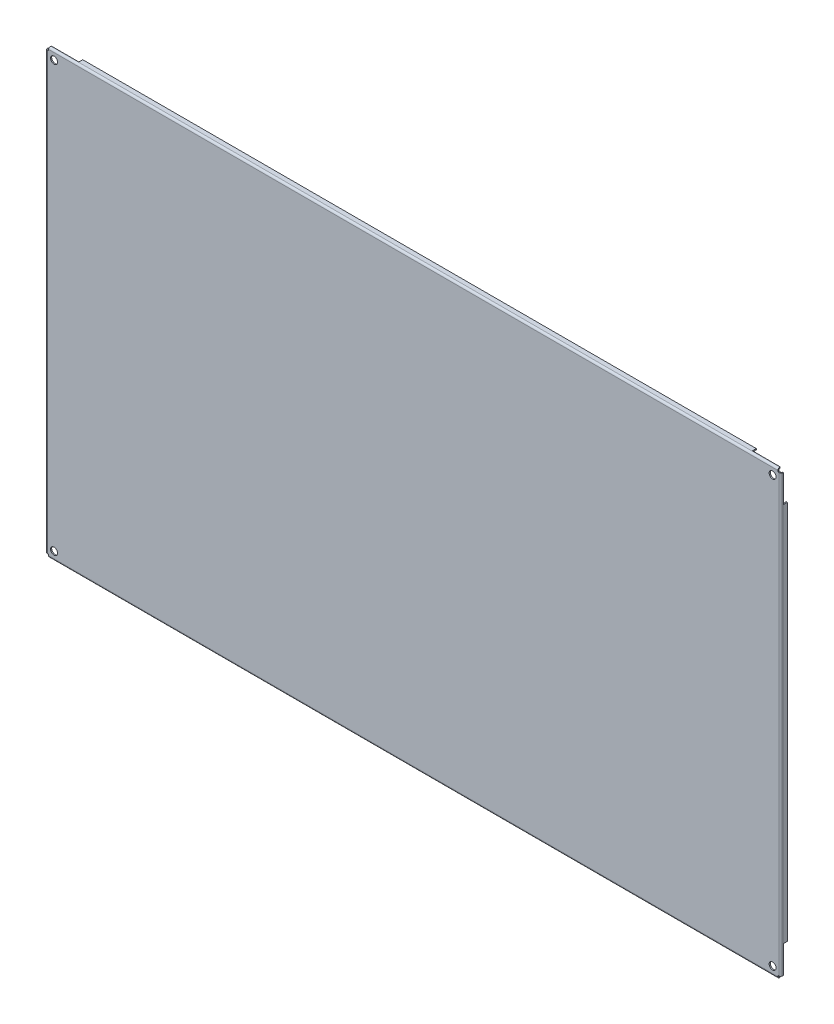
ISO-10303-21;
HEADER;
FILE_DESCRIPTION(('STEP AP214'),'2;1');
FILE_NAME('part.step','',(''),(''),'','','');
FILE_SCHEMA(('AUTOMOTIVE_DESIGN { 1 0 10303 214 1 1 1 1 }'));
ENDSEC;
DATA;
#1=APPLICATION_CONTEXT('core data for automotive mechanical design processes');
#2=APPLICATION_PROTOCOL_DEFINITION('international standard','automotive_design',2000,#1);
#3=PRODUCT_CONTEXT('',#1,'mechanical');
#4=PRODUCT('Part','Part','',(#3));
#5=PRODUCT_RELATED_PRODUCT_CATEGORY('part','',(#4));
#6=PRODUCT_DEFINITION_FORMATION('','',#4);
#7=PRODUCT_DEFINITION_CONTEXT('part definition',#1,'design');
#8=PRODUCT_DEFINITION('design','',#6,#7);
#9=PRODUCT_DEFINITION_SHAPE('','',#8);
#10=(LENGTH_UNIT() NAMED_UNIT(*) SI_UNIT(.MILLI.,.METRE.));
#11=(NAMED_UNIT(*) PLANE_ANGLE_UNIT() SI_UNIT($,.RADIAN.));
#12=(NAMED_UNIT(*) SI_UNIT($,.STERADIAN.) SOLID_ANGLE_UNIT());
#13=UNCERTAINTY_MEASURE_WITH_UNIT(LENGTH_MEASURE(1.E-05),#10,'distance_accuracy_value','');
#14=(GEOMETRIC_REPRESENTATION_CONTEXT(3) GLOBAL_UNCERTAINTY_ASSIGNED_CONTEXT((#13)) GLOBAL_UNIT_ASSIGNED_CONTEXT((#10,
#11,#12)) REPRESENTATION_CONTEXT('',''));
#15=CARTESIAN_POINT('',(0.,0.,0.));
#16=DIRECTION('',(0.,0.,1.));
#17=DIRECTION('',(1.,0.,0.));
#18=AXIS2_PLACEMENT_3D('',#15,#16,#17);
#19=CARTESIAN_POINT('',(0.,0.,0.));
#20=DIRECTION('',(0.,-1.,0.));
#21=DIRECTION('',(0.,0.,-1.));
#22=AXIS2_PLACEMENT_3D('',#19,#20,#21);
#23=PLANE('',#22);
#24=DIRECTION('',(0.,0.,1.));
#25=VECTOR('',#24,1.);
#26=CARTESIAN_POINT('',(469.585786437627,0.,0.));
#27=LINE('',#26,#25);
#28=CARTESIAN_POINT('',(469.585786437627,0.,1.));
#29=VERTEX_POINT('',#28);
#30=CARTESIAN_POINT('',(469.585786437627,0.,1.5));
#31=VERTEX_POINT('',#30);
#32=EDGE_CURVE('E331',#29,#31,#27,.T.);
#33=ORIENTED_EDGE('',*,*,#32,.T.);
#34=DIRECTION('',(1.,0.,0.));
#35=VECTOR('',#34,1.);
#36=CARTESIAN_POINT('',(0.,0.,1.5));
#37=LINE('',#36,#35);
#38=CARTESIAN_POINT('',(-469.585786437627,0.,1.5));
#39=VERTEX_POINT('',#38);
#40=EDGE_CURVE('E326',#39,#31,#37,.T.);
#41=ORIENTED_EDGE('',*,*,#40,.F.);
#42=DIRECTION('',(0.,0.,-1.));
#43=VECTOR('',#42,1.);
#44=CARTESIAN_POINT('',(-469.585786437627,0.,0.));
#45=LINE('',#44,#43);
#46=CARTESIAN_POINT('',(-469.585786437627,0.,1.));
#47=VERTEX_POINT('',#46);
#48=EDGE_CURVE('E320',#39,#47,#45,.T.);
#49=ORIENTED_EDGE('',*,*,#48,.T.);
#50=DIRECTION('',(-1.,0.,0.));
#51=VECTOR('',#50,1.);
#52=CARTESIAN_POINT('',(0.,0.,1.));
#53=LINE('',#52,#51);
#54=CARTESIAN_POINT('',(-434.,0.,1.));
#55=VERTEX_POINT('',#54);
#56=EDGE_CURVE('E323',#55,#47,#53,.T.);
#57=ORIENTED_EDGE('',*,*,#56,.F.);
#58=DIRECTION('',(0.,0.,-1.));
#59=VECTOR('',#58,1.);
#60=CARTESIAN_POINT('',(-434.,0.,0.));
#61=LINE('',#60,#59);
#62=CARTESIAN_POINT('',(-434.,0.,-4.));
#63=VERTEX_POINT('',#62);
#64=EDGE_CURVE('E392',#55,#63,#61,.T.);
#65=ORIENTED_EDGE('',*,*,#64,.T.);
#66=DIRECTION('',(1.,0.,0.));
#67=VECTOR('',#66,1.);
#68=CARTESIAN_POINT('',(0.,0.,-4.));
#69=LINE('',#68,#67);
#70=CARTESIAN_POINT('',(434.,0.,-4.));
#71=VERTEX_POINT('',#70);
#72=EDGE_CURVE('E383',#63,#71,#69,.T.);
#73=ORIENTED_EDGE('',*,*,#72,.T.);
#74=DIRECTION('',(0.,0.,1.));
#75=VECTOR('',#74,1.);
#76=CARTESIAN_POINT('',(434.,0.,0.));
#77=LINE('',#76,#75);
#78=CARTESIAN_POINT('',(434.,0.,1.));
#79=VERTEX_POINT('',#78);
#80=EDGE_CURVE('E373',#71,#79,#77,.T.);
#81=ORIENTED_EDGE('',*,*,#80,.T.);
#82=DIRECTION('',(1.,0.,0.));
#83=VECTOR('',#82,1.);
#84=CARTESIAN_POINT('',(0.,0.,1.));
#85=LINE('',#84,#83);
#86=EDGE_CURVE('E361',#79,#29,#85,.T.);
#87=ORIENTED_EDGE('',*,*,#86,.T.);
#88=EDGE_LOOP('',(#33,#41,#49,#57,#65,#73,#81,#87));
#89=FACE_BOUND('',#88,.T.);
#90=ADVANCED_FACE('F17',(#89),#23,.T.);
#91=CARTESIAN_POINT('',(-474.,570.,4.));
#92=DIRECTION('',(1.,0.,0.));
#93=DIRECTION('',(0.,0.,-1.));
#94=AXIS2_PLACEMENT_3D('',#91,#92,#93);
#95=PLANE('',#94);
#96=DIRECTION('',(0.,1.,0.));
#97=VECTOR('',#96,1.);
#98=CARTESIAN_POINT('',(-474.,570.,1.));
#99=LINE('',#98,#97);
#100=CARTESIAN_POINT('',(-474.,565.585786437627,1.));
#101=VERTEX_POINT('',#100);
#102=CARTESIAN_POINT('',(-474.,530.,1.));
#103=VERTEX_POINT('',#102);
#104=EDGE_CURVE('E515',#101,#103,#99,.F.);
#105=ORIENTED_EDGE('',*,*,#104,.T.);
#106=DIRECTION('',(0.,0.,-1.));
#107=VECTOR('',#106,1.);
#108=CARTESIAN_POINT('',(-474.,530.,4.));
#109=LINE('',#108,#107);
#110=CARTESIAN_POINT('',(-474.,530.,-4.));
#111=VERTEX_POINT('',#110);
#112=EDGE_CURVE('E526',#103,#111,#109,.T.);
#113=ORIENTED_EDGE('',*,*,#112,.T.);
#114=DIRECTION('',(0.,1.,0.));
#115=VECTOR('',#114,1.);
#116=CARTESIAN_POINT('',(-474.,570.,-4.));
#117=LINE('',#116,#115);
#118=CARTESIAN_POINT('',(-474.,40.,-4.));
#119=VERTEX_POINT('',#118);
#120=EDGE_CURVE('E535',#111,#119,#117,.F.);
#121=ORIENTED_EDGE('',*,*,#120,.T.);
#122=DIRECTION('',(0.,0.,1.));
#123=VECTOR('',#122,1.);
#124=CARTESIAN_POINT('',(-474.,40.,4.));
#125=LINE('',#124,#123);
#126=CARTESIAN_POINT('',(-474.,40.,1.));
#127=VERTEX_POINT('',#126);
#128=EDGE_CURVE('E523',#119,#127,#125,.T.);
#129=ORIENTED_EDGE('',*,*,#128,.T.);
#130=DIRECTION('',(0.,1.,0.));
#131=VECTOR('',#130,1.);
#132=CARTESIAN_POINT('',(-474.,570.,1.));
#133=LINE('',#132,#131);
#134=CARTESIAN_POINT('',(-474.,4.41421356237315,1.));
#135=VERTEX_POINT('',#134);
#136=EDGE_CURVE('E345',#135,#127,#133,.T.);
#137=ORIENTED_EDGE('',*,*,#136,.F.);
#138=DIRECTION('',(0.,0.,-1.));
#139=VECTOR('',#138,1.);
#140=CARTESIAN_POINT('',(-474.,4.41421356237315,4.));
#141=LINE('',#140,#139);
#142=CARTESIAN_POINT('',(-474.,4.41421356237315,1.5));
#143=VERTEX_POINT('',#142);
#144=EDGE_CURVE('E532',#143,#135,#141,.T.);
#145=ORIENTED_EDGE('',*,*,#144,.F.);
#146=DIRECTION('',(0.,1.,0.));
#147=VECTOR('',#146,1.);
#148=CARTESIAN_POINT('',(-474.,570.,1.5));
#149=LINE('',#148,#147);
#150=CARTESIAN_POINT('',(-474.,565.585786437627,1.5));
#151=VERTEX_POINT('',#150);
#152=EDGE_CURVE('E1172',#151,#143,#149,.F.);
#153=ORIENTED_EDGE('',*,*,#152,.F.);
#154=DIRECTION('',(0.,0.,1.));
#155=VECTOR('',#154,1.);
#156=CARTESIAN_POINT('',(-474.,565.585786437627,2.5));
#157=LINE('',#156,#155);
#158=EDGE_CURVE('E1177',#101,#151,#157,.T.);
#159=ORIENTED_EDGE('',*,*,#158,.F.);
#160=EDGE_LOOP('',(#105,#113,#121,#129,#137,#145,#153,#159));
#161=FACE_BOUND('',#160,.T.);
#162=ADVANCED_FACE('F808',(#161),#95,.F.);
#163=CARTESIAN_POINT('',(0.,570.,0.));
#164=DIRECTION('',(0.,-1.,0.));
#165=DIRECTION('',(0.,0.,-1.));
#166=AXIS2_PLACEMENT_3D('',#163,#164,#165);
#167=PLANE('',#166);
#168=DIRECTION('',(-1.,0.,0.));
#169=VECTOR('',#168,1.);
#170=CARTESIAN_POINT('',(0.,570.,1.));
#171=LINE('',#170,#169);
#172=CARTESIAN_POINT('',(434.,570.,1.));
#173=VERTEX_POINT('',#172);
#174=CARTESIAN_POINT('',(469.585786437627,570.,1.));
#175=VERTEX_POINT('',#174);
#176=EDGE_CURVE('E500',#173,#175,#171,.F.);
#177=ORIENTED_EDGE('',*,*,#176,.F.);
#178=DIRECTION('',(0.,0.,1.));
#179=VECTOR('',#178,1.);
#180=CARTESIAN_POINT('',(434.,570.,0.));
#181=LINE('',#180,#179);
#182=CARTESIAN_POINT('',(434.,570.,-4.));
#183=VERTEX_POINT('',#182);
#184=EDGE_CURVE('E1154',#173,#183,#181,.F.);
#185=ORIENTED_EDGE('',*,*,#184,.T.);
#186=DIRECTION('',(1.,0.,0.));
#187=VECTOR('',#186,1.);
#188=CARTESIAN_POINT('',(0.,570.,-4.));
#189=LINE('',#188,#187);
#190=CARTESIAN_POINT('',(-434.,570.,-4.));
#191=VERTEX_POINT('',#190);
#192=EDGE_CURVE('E493',#183,#191,#189,.F.);
#193=ORIENTED_EDGE('',*,*,#192,.T.);
#194=DIRECTION('',(0.,0.,-1.));
#195=VECTOR('',#194,1.);
#196=CARTESIAN_POINT('',(-434.,570.,0.));
#197=LINE('',#196,#195);
#198=CARTESIAN_POINT('',(-434.,570.,1.));
#199=VERTEX_POINT('',#198);
#200=EDGE_CURVE('E481',#191,#199,#197,.F.);
#201=ORIENTED_EDGE('',*,*,#200,.T.);
#202=DIRECTION('',(1.,0.,0.));
#203=VECTOR('',#202,1.);
#204=CARTESIAN_POINT('',(0.,570.,1.));
#205=LINE('',#204,#203);
#206=CARTESIAN_POINT('',(-469.585786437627,570.,1.));
#207=VERTEX_POINT('',#206);
#208=EDGE_CURVE('E478',#199,#207,#205,.F.);
#209=ORIENTED_EDGE('',*,*,#208,.T.);
#210=DIRECTION('',(0.,0.,-1.));
#211=VECTOR('',#210,1.);
#212=CARTESIAN_POINT('',(-469.585786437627,570.,0.));
#213=LINE('',#212,#211);
#214=CARTESIAN_POINT('',(-469.585786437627,570.,1.5));
#215=VERTEX_POINT('',#214);
#216=EDGE_CURVE('E449',#215,#207,#213,.T.);
#217=ORIENTED_EDGE('',*,*,#216,.F.);
#218=DIRECTION('',(-1.,0.,0.));
#219=VECTOR('',#218,1.);
#220=CARTESIAN_POINT('',(-474.,570.,1.5));
#221=LINE('',#220,#219);
#222=CARTESIAN_POINT('',(469.585786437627,570.,1.5));
#223=VERTEX_POINT('',#222);
#224=EDGE_CURVE('E499',#223,#215,#221,.T.);
#225=ORIENTED_EDGE('',*,*,#224,.F.);
#226=DIRECTION('',(0.,0.,-1.));
#227=VECTOR('',#226,1.);
#228=CARTESIAN_POINT('',(469.585786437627,570.,2.5));
#229=LINE('',#228,#227);
#230=EDGE_CURVE('E1167',#175,#223,#229,.F.);
#231=ORIENTED_EDGE('',*,*,#230,.F.);
#232=EDGE_LOOP('',(#177,#185,#193,#201,#209,#217,#225,#231));
#233=FACE_BOUND('',#232,.T.);
#234=ADVANCED_FACE('F811',(#233),#167,.F.);
#235=CARTESIAN_POINT('',(474.,570.,4.));
#236=DIRECTION('',(-1.,0.,0.));
#237=DIRECTION('',(0.,0.,1.));
#238=AXIS2_PLACEMENT_3D('',#235,#236,#237);
#239=PLANE('',#238);
#240=DIRECTION('',(0.,1.,0.));
#241=VECTOR('',#240,1.);
#242=CARTESIAN_POINT('',(474.,570.,1.));
#243=LINE('',#242,#241);
#244=CARTESIAN_POINT('',(474.,4.41421356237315,1.));
#245=VERTEX_POINT('',#244);
#246=CARTESIAN_POINT('',(474.,40.,1.));
#247=VERTEX_POINT('',#246);
#248=EDGE_CURVE('E463',#245,#247,#243,.T.);
#249=ORIENTED_EDGE('',*,*,#248,.T.);
#250=DIRECTION('',(0.,0.,1.));
#251=VECTOR('',#250,1.);
#252=CARTESIAN_POINT('',(474.,40.,4.));
#253=LINE('',#252,#251);
#254=CARTESIAN_POINT('',(474.,40.,-4.));
#255=VERTEX_POINT('',#254);
#256=EDGE_CURVE('E1127',#247,#255,#253,.F.);
#257=ORIENTED_EDGE('',*,*,#256,.T.);
#258=DIRECTION('',(0.,1.,0.));
#259=VECTOR('',#258,1.);
#260=CARTESIAN_POINT('',(474.,570.,-4.));
#261=LINE('',#260,#259);
#262=CARTESIAN_POINT('',(474.,530.,-4.));
#263=VERTEX_POINT('',#262);
#264=EDGE_CURVE('E1129',#263,#255,#261,.F.);
#265=ORIENTED_EDGE('',*,*,#264,.F.);
#266=DIRECTION('',(0.,0.,-1.));
#267=VECTOR('',#266,1.);
#268=CARTESIAN_POINT('',(474.,530.,4.));
#269=LINE('',#268,#267);
#270=CARTESIAN_POINT('',(474.,530.,1.));
#271=VERTEX_POINT('',#270);
#272=EDGE_CURVE('E444',#263,#271,#269,.F.);
#273=ORIENTED_EDGE('',*,*,#272,.T.);
#274=DIRECTION('',(0.,1.,0.));
#275=VECTOR('',#274,1.);
#276=CARTESIAN_POINT('',(474.,570.,1.));
#277=LINE('',#276,#275);
#278=CARTESIAN_POINT('',(474.,565.585786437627,1.));
#279=VERTEX_POINT('',#278);
#280=EDGE_CURVE('E441',#279,#271,#277,.F.);
#281=ORIENTED_EDGE('',*,*,#280,.F.);
#282=DIRECTION('',(0.,0.,1.));
#283=VECTOR('',#282,1.);
#284=CARTESIAN_POINT('',(474.,565.585786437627,4.));
#285=LINE('',#284,#283);
#286=CARTESIAN_POINT('',(474.,565.585786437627,1.5));
#287=VERTEX_POINT('',#286);
#288=EDGE_CURVE('E160',#287,#279,#285,.F.);
#289=ORIENTED_EDGE('',*,*,#288,.F.);
#290=DIRECTION('',(0.,1.,0.));
#291=VECTOR('',#290,1.);
#292=CARTESIAN_POINT('',(474.,570.,1.5));
#293=LINE('',#292,#291);
#294=CARTESIAN_POINT('',(474.,4.41421356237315,1.5));
#295=VERTEX_POINT('',#294);
#296=EDGE_CURVE('E1122',#295,#287,#293,.T.);
#297=ORIENTED_EDGE('',*,*,#296,.F.);
#298=DIRECTION('',(0.,0.,-1.));
#299=VECTOR('',#298,1.);
#300=CARTESIAN_POINT('',(474.,4.41421356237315,4.));
#301=LINE('',#300,#299);
#302=EDGE_CURVE('E962',#245,#295,#301,.F.);
#303=ORIENTED_EDGE('',*,*,#302,.F.);
#304=EDGE_LOOP('',(#249,#257,#265,#273,#281,#289,#297,#303));
#305=FACE_BOUND('',#304,.T.);
#306=ADVANCED_FACE('F815',(#305),#239,.F.);
#307=CARTESIAN_POINT('',(0.,1.5,1.));
#308=DIRECTION('',(0.,0.,-1.));
#309=DIRECTION('',(-1.,0.,0.));
#310=AXIS2_PLACEMENT_3D('',#307,#308,#309);
#311=PLANE('',#310);
#312=DIRECTION('',(0.,1.,0.));
#313=VECTOR('',#312,1.);
#314=CARTESIAN_POINT('',(-469.585786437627,1.5,1.));
#315=LINE('',#314,#313);
#316=CARTESIAN_POINT('',(-469.585786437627,1.5,1.));
#317=VERTEX_POINT('',#316);
#318=EDGE_CURVE('E330',#47,#317,#315,.T.);
#319=ORIENTED_EDGE('',*,*,#318,.T.);
#320=DIRECTION('',(1.,0.,0.));
#321=VECTOR('',#320,1.);
#322=CARTESIAN_POINT('',(0.,1.5,1.));
#323=LINE('',#322,#321);
#324=CARTESIAN_POINT('',(-434.,1.5,1.));
#325=VERTEX_POINT('',#324);
#326=EDGE_CURVE('E353',#317,#325,#323,.T.);
#327=ORIENTED_EDGE('',*,*,#326,.T.);
#328=DIRECTION('',(0.,1.,0.));
#329=VECTOR('',#328,1.);
#330=CARTESIAN_POINT('',(-434.,1.5,1.));
#331=LINE('',#330,#329);
#332=EDGE_CURVE('E337',#325,#55,#331,.F.);
#333=ORIENTED_EDGE('',*,*,#332,.T.);
#334=ORIENTED_EDGE('',*,*,#56,.T.);
#335=EDGE_LOOP('',(#319,#327,#333,#334));
#336=FACE_BOUND('',#335,.T.);
#337=ADVANCED_FACE('F334',(#336),#311,.T.);
#338=CARTESIAN_POINT('',(-434.,1.5,0.));
#339=DIRECTION('',(1.,0.,0.));
#340=DIRECTION('',(0.,0.,-1.));
#341=AXIS2_PLACEMENT_3D('',#338,#339,#340);
#342=PLANE('',#341);
#343=ORIENTED_EDGE('',*,*,#64,.F.);
#344=ORIENTED_EDGE('',*,*,#332,.F.);
#345=DIRECTION('',(0.,0.,-1.));
#346=VECTOR('',#345,1.);
#347=CARTESIAN_POINT('',(-434.,1.5,0.));
#348=LINE('',#347,#346);
#349=CARTESIAN_POINT('',(-434.,1.5,-4.));
#350=VERTEX_POINT('',#349);
#351=EDGE_CURVE('E355',#325,#350,#348,.T.);
#352=ORIENTED_EDGE('',*,*,#351,.T.);
#353=DIRECTION('',(0.,1.,0.));
#354=VECTOR('',#353,1.);
#355=CARTESIAN_POINT('',(-434.,1.5,-4.));
#356=LINE('',#355,#354);
#357=EDGE_CURVE('E389',#350,#63,#356,.F.);
#358=ORIENTED_EDGE('',*,*,#357,.T.);
#359=EDGE_LOOP('',(#343,#344,#352,#358));
#360=FACE_BOUND('',#359,.T.);
#361=ADVANCED_FACE('F822',(#360),#342,.F.);
#362=CARTESIAN_POINT('',(0.,1.5,-4.));
#363=DIRECTION('',(0.,0.,1.));
#364=DIRECTION('',(1.,0.,0.));
#365=AXIS2_PLACEMENT_3D('',#362,#363,#364);
#366=PLANE('',#365);
#367=ORIENTED_EDGE('',*,*,#72,.F.);
#368=ORIENTED_EDGE('',*,*,#357,.F.);
#369=DIRECTION('',(1.,0.,0.));
#370=VECTOR('',#369,1.);
#371=CARTESIAN_POINT('',(0.,1.5,-4.));
#372=LINE('',#371,#370);
#373=CARTESIAN_POINT('',(434.,1.5,-4.));
#374=VERTEX_POINT('',#373);
#375=EDGE_CURVE('E377',#350,#374,#372,.T.);
#376=ORIENTED_EDGE('',*,*,#375,.T.);
#377=DIRECTION('',(0.,1.,0.));
#378=VECTOR('',#377,1.);
#379=CARTESIAN_POINT('',(434.,1.5,-4.));
#380=LINE('',#379,#378);
#381=EDGE_CURVE('E380',#374,#71,#380,.F.);
#382=ORIENTED_EDGE('',*,*,#381,.T.);
#383=EDGE_LOOP('',(#367,#368,#376,#382));
#384=FACE_BOUND('',#383,.T.);
#385=ADVANCED_FACE('F825',(#384),#366,.F.);
#386=CARTESIAN_POINT('',(434.,1.5,0.));
#387=DIRECTION('',(-1.,0.,0.));
#388=DIRECTION('',(0.,0.,1.));
#389=AXIS2_PLACEMENT_3D('',#386,#387,#388);
#390=PLANE('',#389);
#391=ORIENTED_EDGE('',*,*,#80,.F.);
#392=ORIENTED_EDGE('',*,*,#381,.F.);
#393=DIRECTION('',(0.,0.,-1.));
#394=VECTOR('',#393,1.);
#395=CARTESIAN_POINT('',(434.,1.5,0.));
#396=LINE('',#395,#394);
#397=CARTESIAN_POINT('',(434.,1.5,1.));
#398=VERTEX_POINT('',#397);
#399=EDGE_CURVE('E367',#374,#398,#396,.F.);
#400=ORIENTED_EDGE('',*,*,#399,.T.);
#401=DIRECTION('',(0.,1.,0.));
#402=VECTOR('',#401,1.);
#403=CARTESIAN_POINT('',(434.,1.5,1.));
#404=LINE('',#403,#402);
#405=EDGE_CURVE('E370',#398,#79,#404,.F.);
#406=ORIENTED_EDGE('',*,*,#405,.T.);
#407=EDGE_LOOP('',(#391,#392,#400,#406));
#408=FACE_BOUND('',#407,.T.);
#409=ADVANCED_FACE('F829',(#408),#390,.F.);
#410=CARTESIAN_POINT('',(0.,1.5,1.));
#411=DIRECTION('',(0.,0.,1.));
#412=DIRECTION('',(1.,0.,0.));
#413=AXIS2_PLACEMENT_3D('',#410,#411,#412);
#414=PLANE('',#413);
#415=ORIENTED_EDGE('',*,*,#86,.F.);
#416=ORIENTED_EDGE('',*,*,#405,.F.);
#417=DIRECTION('',(1.,0.,0.));
#418=VECTOR('',#417,1.);
#419=CARTESIAN_POINT('',(0.,1.5,1.));
#420=LINE('',#419,#418);
#421=CARTESIAN_POINT('',(469.585786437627,1.5,1.));
#422=VERTEX_POINT('',#421);
#423=EDGE_CURVE('E364',#398,#422,#420,.T.);
#424=ORIENTED_EDGE('',*,*,#423,.T.);
#425=DIRECTION('',(0.,1.,0.));
#426=VECTOR('',#425,1.);
#427=CARTESIAN_POINT('',(469.585786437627,1.5,1.));
#428=LINE('',#427,#426);
#429=EDGE_CURVE('E358',#422,#29,#428,.F.);
#430=ORIENTED_EDGE('',*,*,#429,.T.);
#431=EDGE_LOOP('',(#415,#416,#424,#430));
#432=FACE_BOUND('',#431,.T.);
#433=ADVANCED_FACE('F833',(#432),#414,.F.);
#434=CARTESIAN_POINT('',(469.585786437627,1.5,0.));
#435=DIRECTION('',(-1.,0.,0.));
#436=DIRECTION('',(0.,0.,1.));
#437=AXIS2_PLACEMENT_3D('',#434,#435,#436);
#438=PLANE('',#437);
#439=ORIENTED_EDGE('',*,*,#32,.F.);
#440=ORIENTED_EDGE('',*,*,#429,.F.);
#441=DIRECTION('',(0.,0.,-1.));
#442=VECTOR('',#441,1.);
#443=CARTESIAN_POINT('',(469.585786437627,1.5,0.));
#444=LINE('',#443,#442);
#445=CARTESIAN_POINT('',(469.585786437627,1.5,1.5));
#446=VERTEX_POINT('',#445);
#447=EDGE_CURVE('E366',#422,#446,#444,.F.);
#448=ORIENTED_EDGE('',*,*,#447,.T.);
#449=DIRECTION('',(0.,1.,0.));
#450=VECTOR('',#449,1.);
#451=CARTESIAN_POINT('',(469.585786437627,0.75,1.5));
#452=LINE('',#451,#450);
#453=EDGE_CURVE('E1113',#31,#446,#452,.T.);
#454=ORIENTED_EDGE('',*,*,#453,.F.);
#455=EDGE_LOOP('',(#439,#440,#448,#454));
#456=FACE_BOUND('',#455,.T.);
#457=ADVANCED_FACE('F837',(#456),#438,.F.);
#458=CARTESIAN_POINT('',(-469.585786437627,1.5,0.));
#459=DIRECTION('',(1.,0.,0.));
#460=DIRECTION('',(0.,0.,-1.));
#461=AXIS2_PLACEMENT_3D('',#458,#459,#460);
#462=PLANE('',#461);
#463=ORIENTED_EDGE('',*,*,#48,.F.);
#464=DIRECTION('',(0.,-1.,0.));
#465=VECTOR('',#464,1.);
#466=CARTESIAN_POINT('',(-469.585786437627,0.75,1.5));
#467=LINE('',#466,#465);
#468=CARTESIAN_POINT('',(-469.585786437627,1.5,1.5));
#469=VERTEX_POINT('',#468);
#470=EDGE_CURVE('E1110',#469,#39,#467,.T.);
#471=ORIENTED_EDGE('',*,*,#470,.F.);
#472=DIRECTION('',(0.,0.,-1.));
#473=VECTOR('',#472,1.);
#474=CARTESIAN_POINT('',(-469.585786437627,1.5,0.));
#475=LINE('',#474,#473);
#476=EDGE_CURVE('E342',#469,#317,#475,.T.);
#477=ORIENTED_EDGE('',*,*,#476,.T.);
#478=ORIENTED_EDGE('',*,*,#318,.F.);
#479=EDGE_LOOP('',(#463,#471,#477,#478));
#480=FACE_BOUND('',#479,.T.);
#481=ADVANCED_FACE('F340',(#480),#462,.F.);
#482=CARTESIAN_POINT('',(0.,2.5,1.5));
#483=DIRECTION('',(1.,0.,0.));
#484=DIRECTION('',(0.,0.,-1.));
#485=AXIS2_PLACEMENT_3D('',#482,#483,#484);
#486=CYLINDRICAL_SURFACE('',#485,2.5);
#487=CARTESIAN_POINT('',(470.,2.5,4.));
#488=CARTESIAN_POINT('',(469.999990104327,2.43503514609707,4.00000716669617));
#489=CARTESIAN_POINT('',(469.998839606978,2.3700851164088,3.99746790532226));
#490=CARTESIAN_POINT('',(469.994583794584,2.24066759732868,3.98735772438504));
#491=CARTESIAN_POINT('',(469.991479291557,2.17619991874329,3.97978889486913));
#492=CARTESIAN_POINT('',(469.983649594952,2.04828077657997,3.95970195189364));
#493=CARTESIAN_POINT('',(469.978927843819,1.98482745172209,3.94719434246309));
#494=CARTESIAN_POINT('',(469.96812996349,1.85919674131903,3.91734262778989));
#495=CARTESIAN_POINT('',(469.96205368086,1.79701950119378,3.8999979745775));
#496=CARTESIAN_POINT('',(469.941762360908,1.60919599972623,3.83967369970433));
#497=CARTESIAN_POINT('',(469.925746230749,1.48611584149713,3.78900635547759));
#498=CARTESIAN_POINT('',(469.89083277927,1.2498625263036,3.66904322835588));
#499=CARTESIAN_POINT('',(469.871933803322,1.13669511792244,3.59973672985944));
#500=CARTESIAN_POINT('',(469.831621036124,0.916713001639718,3.43977461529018));
#501=CARTESIAN_POINT('',(469.810125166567,0.810635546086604,3.34812208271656));
#502=CARTESIAN_POINT('',(469.767235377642,0.615222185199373,3.14837717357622));
#503=CARTESIAN_POINT('',(469.745841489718,0.525891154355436,3.04028002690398));
#504=CARTESIAN_POINT('',(469.704466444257,0.364997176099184,2.8084402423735));
#505=CARTESIAN_POINT('',(469.684516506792,0.293772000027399,2.68445721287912));
#506=CARTESIAN_POINT('',(469.648372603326,0.173363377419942,2.42578882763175));
#507=CARTESIAN_POINT('',(469.632175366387,0.124160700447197,2.29111293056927));
#508=CARTESIAN_POINT('',(469.608970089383,0.0580945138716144,2.04696003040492));
#509=CARTESIAN_POINT('',(469.60070102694,0.0363713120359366,1.93890652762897));
#510=CARTESIAN_POINT('',(469.592011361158,0.0145839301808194,1.77521638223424));
#511=CARTESIAN_POINT('',(469.589733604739,0.00912101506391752,1.72035946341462));
#512=CARTESIAN_POINT('',(469.586623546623,0.00182730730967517,1.610341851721));
#513=CARTESIAN_POINT('',(469.585791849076,-1.96727089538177E-06,1.55518104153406));
#514=CARTESIAN_POINT('',(469.585786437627,0.,1.5));
#515=B_SPLINE_CURVE_WITH_KNOTS('',3,(#487,#488,#489,#490,#491,#492,#493,#494,#495,#496,#497,
#498,#499,#500,#501,#502,#503,#504,#505,#506,#507,#508,#509,#510,#511,#512,#513,#514),
.UNSPECIFIED.,.F.,.F.,(4,2,2,2,2,2,2,2,2,2,2,2,2,4),(0.,0.194812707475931,0.389544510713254,
0.58386436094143,0.778206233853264,1.1784962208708,1.57901682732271,2.00252209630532,
2.42615044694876,2.85718159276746,3.28783561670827,3.61833762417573,3.78373858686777,
3.94920863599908),.UNSPECIFIED.);
#516=CARTESIAN_POINT('',(470.,2.49999999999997,4.));
#517=VERTEX_POINT('',#516);
#518=EDGE_CURVE('E24',#517,#31,#515,.T.);
#519=ORIENTED_EDGE('',*,*,#518,.F.);
#520=DIRECTION('',(-1.,0.,0.));
#521=VECTOR('',#520,1.);
#522=CARTESIAN_POINT('',(-474.,2.49999999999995,4.));
#523=LINE('',#522,#521);
#524=CARTESIAN_POINT('',(-470.,2.49999999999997,4.));
#525=VERTEX_POINT('',#524);
#526=EDGE_CURVE('E409',#517,#525,#523,.T.);
#527=ORIENTED_EDGE('',*,*,#526,.T.);
#528=CARTESIAN_POINT('',(-469.585786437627,0.,1.5));
#529=CARTESIAN_POINT('',(-469.5857963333,-7.16669616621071E-06,1.56496485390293));
#530=CARTESIAN_POINT('',(-469.586946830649,0.00253209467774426,1.6299148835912));
#531=CARTESIAN_POINT('',(-469.591202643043,0.0126422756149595,1.75933240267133));
#532=CARTESIAN_POINT('',(-469.594307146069,0.0202111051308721,1.82380008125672));
#533=CARTESIAN_POINT('',(-469.602136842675,0.0402980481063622,1.95171922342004));
#534=CARTESIAN_POINT('',(-469.606858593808,0.0528056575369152,2.01517254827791));
#535=CARTESIAN_POINT('',(-469.617656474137,0.0826573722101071,2.14080325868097));
#536=CARTESIAN_POINT('',(-469.623732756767,0.100002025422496,2.20298049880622));
#537=CARTESIAN_POINT('',(-469.644024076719,0.160326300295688,2.39080400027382));
#538=CARTESIAN_POINT('',(-469.660040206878,0.210993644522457,2.51388415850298));
#539=CARTESIAN_POINT('',(-469.694953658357,0.330956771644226,2.75013747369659));
#540=CARTESIAN_POINT('',(-469.713852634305,0.400263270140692,2.86330488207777));
#541=CARTESIAN_POINT('',(-469.754165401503,0.560225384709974,3.08328699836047));
#542=CARTESIAN_POINT('',(-469.77566127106,0.651877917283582,3.18936445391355));
#543=CARTESIAN_POINT('',(-469.818551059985,0.851622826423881,3.38477781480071));
#544=CARTESIAN_POINT('',(-469.839944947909,0.959719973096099,3.47410884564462));
#545=CARTESIAN_POINT('',(-469.88131999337,1.19155975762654,3.63500282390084));
#546=CARTESIAN_POINT('',(-469.901269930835,1.31554278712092,3.70622799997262));
#547=CARTESIAN_POINT('',(-469.937413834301,1.5742111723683,3.82663662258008));
#548=CARTESIAN_POINT('',(-469.95361107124,1.70888706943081,3.87583929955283));
#549=CARTESIAN_POINT('',(-469.976816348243,1.95303996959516,3.9419054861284));
#550=CARTESIAN_POINT('',(-469.985085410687,2.06109347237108,3.96362868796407));
#551=CARTESIAN_POINT('',(-469.993775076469,2.22478361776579,3.98541606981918));
#552=CARTESIAN_POINT('',(-469.996052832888,2.2796405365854,3.99087898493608));
#553=CARTESIAN_POINT('',(-469.999162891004,2.38965814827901,3.99817269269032));
#554=CARTESIAN_POINT('',(-469.999994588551,2.44481895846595,4.0000019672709));
#555=CARTESIAN_POINT('',(-470.,2.5,4.));
#556=B_SPLINE_CURVE_WITH_KNOTS('',3,(#528,#529,#530,#531,#532,#533,#534,#535,#536,#537,#538,
#539,#540,#541,#542,#543,#544,#545,#546,#547,#548,#549,#550,#551,#552,#553,#554,#555),
.UNSPECIFIED.,.F.,.F.,(4,2,2,2,2,2,2,2,2,2,2,2,2,4),(0.,0.194812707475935,0.389544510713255,
0.583864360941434,0.778206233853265,1.17849622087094,1.579016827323,2.00252209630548,
2.4261504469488,2.85718159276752,3.28783561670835,3.61833762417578,3.78373858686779,
3.94920863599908),.UNSPECIFIED.);
#557=EDGE_CURVE('E728',#39,#525,#556,.T.);
#558=ORIENTED_EDGE('',*,*,#557,.F.);
#559=ORIENTED_EDGE('',*,*,#40,.T.);
#560=EDGE_LOOP('',(#519,#527,#558,#559));
#561=FACE_BOUND('',#560,.T.);
#562=ADVANCED_FACE('F843',(#561),#486,.T.);
#563=CARTESIAN_POINT('',(-472.5,570.,1.));
#564=DIRECTION('',(0.,0.,-1.));
#565=DIRECTION('',(-1.,0.,0.));
#566=AXIS2_PLACEMENT_3D('',#563,#564,#565);
#567=PLANE('',#566);
#568=DIRECTION('',(1.,0.,0.));
#569=VECTOR('',#568,1.);
#570=CARTESIAN_POINT('',(-472.5,40.,1.));
#571=LINE('',#570,#569);
#572=CARTESIAN_POINT('',(-472.5,40.,1.));
#573=VERTEX_POINT('',#572);
#574=EDGE_CURVE('E537',#127,#573,#571,.T.);
#575=ORIENTED_EDGE('',*,*,#574,.T.);
#576=DIRECTION('',(0.,1.,0.));
#577=VECTOR('',#576,1.);
#578=CARTESIAN_POINT('',(-472.5,570.,1.));
#579=LINE('',#578,#577);
#580=CARTESIAN_POINT('',(-472.5,4.41421356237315,1.));
#581=VERTEX_POINT('',#580);
#582=EDGE_CURVE('E1097',#581,#573,#579,.T.);
#583=ORIENTED_EDGE('',*,*,#582,.F.);
#584=DIRECTION('',(1.,0.,0.));
#585=VECTOR('',#584,1.);
#586=CARTESIAN_POINT('',(-472.5,4.41421356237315,1.));
#587=LINE('',#586,#585);
#588=EDGE_CURVE('E1185',#135,#581,#587,.T.);
#589=ORIENTED_EDGE('',*,*,#588,.F.);
#590=ORIENTED_EDGE('',*,*,#136,.T.);
#591=EDGE_LOOP('',(#575,#583,#589,#590));
#592=FACE_BOUND('',#591,.T.);
#593=ADVANCED_FACE('F847',(#592),#567,.T.);
#594=CARTESIAN_POINT('',(-472.5,40.,4.));
#595=DIRECTION('',(0.,1.,0.));
#596=DIRECTION('',(0.,0.,1.));
#597=AXIS2_PLACEMENT_3D('',#594,#595,#596);
#598=PLANE('',#597);
#599=ORIENTED_EDGE('',*,*,#128,.F.);
#600=DIRECTION('',(1.,0.,0.));
#601=VECTOR('',#600,1.);
#602=CARTESIAN_POINT('',(-472.5,40.,-4.));
#603=LINE('',#602,#601);
#604=CARTESIAN_POINT('',(-472.5,40.,-4.));
#605=VERTEX_POINT('',#604);
#606=EDGE_CURVE('E528',#119,#605,#603,.T.);
#607=ORIENTED_EDGE('',*,*,#606,.T.);
#608=DIRECTION('',(0.,0.,-1.));
#609=VECTOR('',#608,1.);
#610=CARTESIAN_POINT('',(-472.5,40.,4.));
#611=LINE('',#610,#609);
#612=EDGE_CURVE('E1094',#573,#605,#611,.T.);
#613=ORIENTED_EDGE('',*,*,#612,.F.);
#614=ORIENTED_EDGE('',*,*,#574,.F.);
#615=EDGE_LOOP('',(#599,#607,#613,#614));
#616=FACE_BOUND('',#615,.T.);
#617=ADVANCED_FACE('F852',(#616),#598,.F.);
#618=CARTESIAN_POINT('',(-472.5,570.,-4.));
#619=DIRECTION('',(0.,0.,1.));
#620=DIRECTION('',(1.,0.,0.));
#621=AXIS2_PLACEMENT_3D('',#618,#619,#620);
#622=PLANE('',#621);
#623=ORIENTED_EDGE('',*,*,#120,.F.);
#624=DIRECTION('',(1.,0.,0.));
#625=VECTOR('',#624,1.);
#626=CARTESIAN_POINT('',(-472.5,530.,-4.));
#627=LINE('',#626,#625);
#628=CARTESIAN_POINT('',(-472.5,530.,-4.));
#629=VERTEX_POINT('',#628);
#630=EDGE_CURVE('E518',#111,#629,#627,.T.);
#631=ORIENTED_EDGE('',*,*,#630,.T.);
#632=DIRECTION('',(0.,1.,0.));
#633=VECTOR('',#632,1.);
#634=CARTESIAN_POINT('',(-472.5,570.,-4.));
#635=LINE('',#634,#633);
#636=EDGE_CURVE('E1091',#605,#629,#635,.T.);
#637=ORIENTED_EDGE('',*,*,#636,.F.);
#638=ORIENTED_EDGE('',*,*,#606,.F.);
#639=EDGE_LOOP('',(#623,#631,#637,#638));
#640=FACE_BOUND('',#639,.T.);
#641=ADVANCED_FACE('F856',(#640),#622,.F.);
#642=CARTESIAN_POINT('',(-472.5,530.,4.));
#643=DIRECTION('',(0.,-1.,0.));
#644=DIRECTION('',(0.,0.,-1.));
#645=AXIS2_PLACEMENT_3D('',#642,#643,#644);
#646=PLANE('',#645);
#647=ORIENTED_EDGE('',*,*,#112,.F.);
#648=DIRECTION('',(1.,0.,0.));
#649=VECTOR('',#648,1.);
#650=CARTESIAN_POINT('',(-472.5,530.,1.));
#651=LINE('',#650,#649);
#652=CARTESIAN_POINT('',(-472.5,530.,1.));
#653=VERTEX_POINT('',#652);
#654=EDGE_CURVE('E517',#103,#653,#651,.T.);
#655=ORIENTED_EDGE('',*,*,#654,.T.);
#656=DIRECTION('',(0.,0.,-1.));
#657=VECTOR('',#656,1.);
#658=CARTESIAN_POINT('',(-472.5,530.,4.));
#659=LINE('',#658,#657);
#660=EDGE_CURVE('E1088',#629,#653,#659,.F.);
#661=ORIENTED_EDGE('',*,*,#660,.F.);
#662=ORIENTED_EDGE('',*,*,#630,.F.);
#663=EDGE_LOOP('',(#647,#655,#661,#662));
#664=FACE_BOUND('',#663,.T.);
#665=ADVANCED_FACE('F860',(#664),#646,.F.);
#666=CARTESIAN_POINT('',(-472.5,570.,1.));
#667=DIRECTION('',(0.,0.,1.));
#668=DIRECTION('',(1.,0.,0.));
#669=AXIS2_PLACEMENT_3D('',#666,#667,#668);
#670=PLANE('',#669);
#671=ORIENTED_EDGE('',*,*,#104,.F.);
#672=DIRECTION('',(1.,0.,0.));
#673=VECTOR('',#672,1.);
#674=CARTESIAN_POINT('',(-472.5,565.585786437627,1.));
#675=LINE('',#674,#673);
#676=CARTESIAN_POINT('',(-472.5,565.585786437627,1.));
#677=VERTEX_POINT('',#676);
#678=EDGE_CURVE('E1180',#677,#101,#675,.F.);
#679=ORIENTED_EDGE('',*,*,#678,.F.);
#680=DIRECTION('',(0.,1.,0.));
#681=VECTOR('',#680,1.);
#682=CARTESIAN_POINT('',(-472.5,570.,1.));
#683=LINE('',#682,#681);
#684=EDGE_CURVE('E727',#653,#677,#683,.T.);
#685=ORIENTED_EDGE('',*,*,#684,.F.);
#686=ORIENTED_EDGE('',*,*,#654,.F.);
#687=EDGE_LOOP('',(#671,#679,#685,#686));
#688=FACE_BOUND('',#687,.T.);
#689=ADVANCED_FACE('F864',(#688),#670,.F.);
#690=CARTESIAN_POINT('',(-472.5,4.41421356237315,4.));
#691=DIRECTION('',(0.,-1.,0.));
#692=DIRECTION('',(0.,0.,-1.));
#693=AXIS2_PLACEMENT_3D('',#690,#691,#692);
#694=PLANE('',#693);
#695=ORIENTED_EDGE('',*,*,#588,.T.);
#696=DIRECTION('',(0.,0.,-1.));
#697=VECTOR('',#696,1.);
#698=CARTESIAN_POINT('',(-472.5,4.41421356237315,4.));
#699=LINE('',#698,#697);
#700=CARTESIAN_POINT('',(-472.5,4.41421356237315,1.5));
#701=VERTEX_POINT('',#700);
#702=EDGE_CURVE('E1101',#701,#581,#699,.T.);
#703=ORIENTED_EDGE('',*,*,#702,.F.);
#704=DIRECTION('',(1.,0.,0.));
#705=VECTOR('',#704,1.);
#706=CARTESIAN_POINT('',(-473.25,4.41421356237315,1.5));
#707=LINE('',#706,#705);
#708=EDGE_CURVE('E726',#143,#701,#707,.T.);
#709=ORIENTED_EDGE('',*,*,#708,.F.);
#710=ORIENTED_EDGE('',*,*,#144,.T.);
#711=EDGE_LOOP('',(#695,#703,#709,#710));
#712=FACE_BOUND('',#711,.T.);
#713=ADVANCED_FACE('F867',(#712),#694,.T.);
#714=CARTESIAN_POINT('',(-472.5,565.585786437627,2.5));
#715=DIRECTION('',(0.,1.,0.));
#716=DIRECTION('',(0.,0.,1.));
#717=AXIS2_PLACEMENT_3D('',#714,#715,#716);
#718=PLANE('',#717);
#719=DIRECTION('',(-1.,0.,0.));
#720=VECTOR('',#719,1.);
#721=CARTESIAN_POINT('',(-473.25,565.585786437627,1.5));
#722=LINE('',#721,#720);
#723=CARTESIAN_POINT('',(-472.5,565.585786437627,1.5));
#724=VERTEX_POINT('',#723);
#725=EDGE_CURVE('E1083',#724,#151,#722,.T.);
#726=ORIENTED_EDGE('',*,*,#725,.F.);
#727=DIRECTION('',(0.,0.,-1.));
#728=VECTOR('',#727,1.);
#729=CARTESIAN_POINT('',(-472.5,565.585786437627,4.));
#730=LINE('',#729,#728);
#731=EDGE_CURVE('E1098',#677,#724,#730,.F.);
#732=ORIENTED_EDGE('',*,*,#731,.F.);
#733=ORIENTED_EDGE('',*,*,#678,.T.);
#734=ORIENTED_EDGE('',*,*,#158,.T.);
#735=EDGE_LOOP('',(#726,#732,#733,#734));
#736=FACE_BOUND('',#735,.T.);
#737=ADVANCED_FACE('F717',(#736),#718,.T.);
#738=CARTESIAN_POINT('',(-471.5,570.,1.5));
#739=DIRECTION('',(0.,1.,0.));
#740=DIRECTION('',(0.,0.,1.));
#741=AXIS2_PLACEMENT_3D('',#738,#739,#740);
#742=CYLINDRICAL_SURFACE('',#741,2.5);
#743=CARTESIAN_POINT('',(-471.5,4.,4.));
#744=CARTESIAN_POINT('',(-471.564964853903,4.00000989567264,4.00000716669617));
#745=CARTESIAN_POINT('',(-471.629914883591,4.00116039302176,3.99746790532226));
#746=CARTESIAN_POINT('',(-471.759332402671,4.00541620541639,3.98735772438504));
#747=CARTESIAN_POINT('',(-471.823800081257,4.00852070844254,3.97978889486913));
#748=CARTESIAN_POINT('',(-471.95171922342,4.01635040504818,3.95970195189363));
#749=CARTESIAN_POINT('',(-472.015172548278,4.0210721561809,3.94719434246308));
#750=CARTESIAN_POINT('',(-472.140803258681,4.0318700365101,3.91734262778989));
#751=CARTESIAN_POINT('',(-472.202980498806,4.0379463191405,3.8999979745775));
#752=CARTESIAN_POINT('',(-472.390804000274,4.05823763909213,3.83967369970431));
#753=CARTESIAN_POINT('',(-472.513884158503,4.07425376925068,3.78900635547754));
#754=CARTESIAN_POINT('',(-472.750137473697,4.10916722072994,3.6690432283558));
#755=CARTESIAN_POINT('',(-472.863304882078,4.12806619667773,3.59973672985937));
#756=CARTESIAN_POINT('',(-473.083286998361,4.16837896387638,3.4397746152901));
#757=CARTESIAN_POINT('',(-473.189364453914,4.18987483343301,3.34812208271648));
#758=CARTESIAN_POINT('',(-473.384777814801,4.2327646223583,3.14837717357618));
#759=CARTESIAN_POINT('',(-473.474108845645,4.25415851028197,3.04028002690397));
#760=CARTESIAN_POINT('',(-473.635002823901,4.29553355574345,2.80844024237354));
#761=CARTESIAN_POINT('',(-473.706227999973,4.31548349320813,2.68445721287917));
#762=CARTESIAN_POINT('',(-473.82663662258,4.35162739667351,2.42578882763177));
#763=CARTESIAN_POINT('',(-473.875839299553,4.36782463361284,2.29111293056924));
#764=CARTESIAN_POINT('',(-473.941905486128,4.3910299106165,2.04696003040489));
#765=CARTESIAN_POINT('',(-473.963628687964,4.39929897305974,1.93890652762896));
#766=CARTESIAN_POINT('',(-473.985416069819,4.4079886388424,1.77521638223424));
#767=CARTESIAN_POINT('',(-473.990878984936,4.41026639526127,1.72035946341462));
#768=CARTESIAN_POINT('',(-473.99817269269,4.41337645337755,1.61034185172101));
#769=CARTESIAN_POINT('',(-474.000001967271,4.4142081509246,1.55518104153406));
#770=CARTESIAN_POINT('',(-474.,4.41421356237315,1.5));
#771=B_SPLINE_CURVE_WITH_KNOTS('',3,(#743,#744,#745,#746,#747,#748,#749,#750,#751,#752,#753,
#754,#755,#756,#757,#758,#759,#760,#761,#762,#763,#764,#765,#766,#767,#768,#769,#770),
.UNSPECIFIED.,.F.,.F.,(4,2,2,2,2,2,2,2,2,2,2,2,2,4),(0.,0.194812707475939,0.389544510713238,
0.58386436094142,0.778206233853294,1.17849622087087,1.5790168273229,2.0025220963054,
2.42615044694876,2.85718159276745,3.28783561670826,3.61833762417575,3.78373858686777,
3.94920863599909),.UNSPECIFIED.);
#772=CARTESIAN_POINT('',(-471.5,4.,4.));
#773=VERTEX_POINT('',#772);
#774=EDGE_CURVE('E721',#773,#143,#771,.T.);
#775=ORIENTED_EDGE('',*,*,#774,.F.);
#776=DIRECTION('',(0.,1.,0.));
#777=VECTOR('',#776,1.);
#778=CARTESIAN_POINT('',(-471.5,570.,4.));
#779=LINE('',#778,#777);
#780=CARTESIAN_POINT('',(-471.5,566.,4.));
#781=VERTEX_POINT('',#780);
#782=EDGE_CURVE('E430',#773,#781,#779,.T.);
#783=ORIENTED_EDGE('',*,*,#782,.T.);
#784=CARTESIAN_POINT('',(-474.,565.585786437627,1.5));
#785=CARTESIAN_POINT('',(-474.000007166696,565.5857963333,1.56496485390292));
#786=CARTESIAN_POINT('',(-473.997467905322,565.586946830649,1.62991488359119));
#787=CARTESIAN_POINT('',(-473.987357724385,565.591202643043,1.75933240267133));
#788=CARTESIAN_POINT('',(-473.979788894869,565.594307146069,1.82380008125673));
#789=CARTESIAN_POINT('',(-473.959701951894,565.602136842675,1.95171922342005));
#790=CARTESIAN_POINT('',(-473.947194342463,565.606858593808,2.01517254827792));
#791=CARTESIAN_POINT('',(-473.91734262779,565.617656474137,2.14080325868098));
#792=CARTESIAN_POINT('',(-473.899997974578,565.623732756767,2.20298049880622));
#793=CARTESIAN_POINT('',(-473.839673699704,565.644024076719,2.39080400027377));
#794=CARTESIAN_POINT('',(-473.789006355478,565.660040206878,2.51388415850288));
#795=CARTESIAN_POINT('',(-473.669043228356,565.694953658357,2.75013747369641));
#796=CARTESIAN_POINT('',(-473.59973672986,565.713852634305,2.86330488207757));
#797=CARTESIAN_POINT('',(-473.43977461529,565.754165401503,3.0832869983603));
#798=CARTESIAN_POINT('',(-473.348122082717,565.77566127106,3.1893644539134));
#799=CARTESIAN_POINT('',(-473.148377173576,565.818551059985,3.38477781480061));
#800=CARTESIAN_POINT('',(-473.040280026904,565.839944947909,3.47410884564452));
#801=CARTESIAN_POINT('',(-472.808440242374,565.88131999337,3.63500282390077));
#802=CARTESIAN_POINT('',(-472.684457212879,565.901269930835,3.70622799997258));
#803=CARTESIAN_POINT('',(-472.425788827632,565.9374138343,3.82663662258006));
#804=CARTESIAN_POINT('',(-472.291112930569,565.95361107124,3.8758392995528));
#805=CARTESIAN_POINT('',(-472.046960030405,565.976816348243,3.94190548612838));
#806=CARTESIAN_POINT('',(-471.938906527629,565.985085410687,3.96362868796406));
#807=CARTESIAN_POINT('',(-471.775216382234,565.993775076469,3.98541606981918));
#808=CARTESIAN_POINT('',(-471.720359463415,565.996052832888,3.99087898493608));
#809=CARTESIAN_POINT('',(-471.610341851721,565.999162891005,3.99817269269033));
#810=CARTESIAN_POINT('',(-471.555181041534,565.999994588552,4.0000019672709));
#811=CARTESIAN_POINT('',(-471.5,566.,4.));
#812=B_SPLINE_CURVE_WITH_KNOTS('',3,(#784,#785,#786,#787,#788,#789,#790,#791,#792,#793,#794,
#795,#796,#797,#798,#799,#800,#801,#802,#803,#804,#805,#806,#807,#808,#809,#810,#811),
.UNSPECIFIED.,.F.,.F.,(4,2,2,2,2,2,2,2,2,2,2,2,2,4),(0.,0.194812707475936,0.389544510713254,
0.583864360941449,0.778206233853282,1.17849622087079,1.57901682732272,2.00252209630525,
2.42615044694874,2.8571815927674,3.28783561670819,3.6183376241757,3.78373858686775,
3.94920863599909),.UNSPECIFIED.);
#813=EDGE_CURVE('E675',#151,#781,#812,.T.);
#814=ORIENTED_EDGE('',*,*,#813,.F.);
#815=ORIENTED_EDGE('',*,*,#152,.T.);
#816=EDGE_LOOP('',(#775,#783,#814,#815));
#817=FACE_BOUND('',#816,.T.);
#818=ADVANCED_FACE('F712',(#817),#742,.T.);
#819=CARTESIAN_POINT('',(469.585786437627,568.5,2.5));
#820=DIRECTION('',(1.,0.,0.));
#821=DIRECTION('',(0.,0.,-1.));
#822=AXIS2_PLACEMENT_3D('',#819,#820,#821);
#823=PLANE('',#822);
#824=DIRECTION('',(0.,1.,0.));
#825=VECTOR('',#824,1.);
#826=CARTESIAN_POINT('',(469.585786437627,569.25,1.5));
#827=LINE('',#826,#825);
#828=CARTESIAN_POINT('',(469.585786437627,568.5,1.5));
#829=VERTEX_POINT('',#828);
#830=EDGE_CURVE('E670',#829,#223,#827,.T.);
#831=ORIENTED_EDGE('',*,*,#830,.F.);
#832=DIRECTION('',(0.,0.,-1.));
#833=VECTOR('',#832,1.);
#834=CARTESIAN_POINT('',(469.585786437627,568.5,2.5));
#835=LINE('',#834,#833);
#836=CARTESIAN_POINT('',(469.585786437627,568.5,1.));
#837=VERTEX_POINT('',#836);
#838=EDGE_CURVE('E482',#829,#837,#835,.T.);
#839=ORIENTED_EDGE('',*,*,#838,.T.);
#840=DIRECTION('',(0.,1.,0.));
#841=VECTOR('',#840,1.);
#842=CARTESIAN_POINT('',(469.585786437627,568.5,1.));
#843=LINE('',#842,#841);
#844=EDGE_CURVE('E496',#175,#837,#843,.F.);
#845=ORIENTED_EDGE('',*,*,#844,.F.);
#846=ORIENTED_EDGE('',*,*,#230,.T.);
#847=EDGE_LOOP('',(#831,#839,#845,#846));
#848=FACE_BOUND('',#847,.T.);
#849=ADVANCED_FACE('F709',(#848),#823,.T.);
#850=CARTESIAN_POINT('',(0.,568.5,1.));
#851=DIRECTION('',(0.,0.,1.));
#852=DIRECTION('',(1.,0.,0.));
#853=AXIS2_PLACEMENT_3D('',#850,#851,#852);
#854=PLANE('',#853);
#855=ORIENTED_EDGE('',*,*,#208,.F.);
#856=DIRECTION('',(0.,1.,0.));
#857=VECTOR('',#856,1.);
#858=CARTESIAN_POINT('',(-434.,568.5,1.));
#859=LINE('',#858,#857);
#860=CARTESIAN_POINT('',(-434.,568.5,1.));
#861=VERTEX_POINT('',#860);
#862=EDGE_CURVE('E489',#199,#861,#859,.F.);
#863=ORIENTED_EDGE('',*,*,#862,.T.);
#864=DIRECTION('',(1.,0.,0.));
#865=VECTOR('',#864,1.);
#866=CARTESIAN_POINT('',(0.,568.5,1.));
#867=LINE('',#866,#865);
#868=CARTESIAN_POINT('',(-469.585786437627,568.5,1.));
#869=VERTEX_POINT('',#868);
#870=EDGE_CURVE('E1072',#869,#861,#867,.T.);
#871=ORIENTED_EDGE('',*,*,#870,.F.);
#872=DIRECTION('',(0.,1.,0.));
#873=VECTOR('',#872,1.);
#874=CARTESIAN_POINT('',(-469.585786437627,568.5,1.));
#875=LINE('',#874,#873);
#876=EDGE_CURVE('E1145',#207,#869,#875,.F.);
#877=ORIENTED_EDGE('',*,*,#876,.F.);
#878=EDGE_LOOP('',(#855,#863,#871,#877));
#879=FACE_BOUND('',#878,.T.);
#880=ADVANCED_FACE('F705',(#879),#854,.F.);
#881=CARTESIAN_POINT('',(-434.,568.5,0.));
#882=DIRECTION('',(1.,0.,0.));
#883=DIRECTION('',(0.,0.,-1.));
#884=AXIS2_PLACEMENT_3D('',#881,#882,#883);
#885=PLANE('',#884);
#886=ORIENTED_EDGE('',*,*,#200,.F.);
#887=DIRECTION('',(0.,1.,0.));
#888=VECTOR('',#887,1.);
#889=CARTESIAN_POINT('',(-434.,568.5,-4.));
#890=LINE('',#889,#888);
#891=CARTESIAN_POINT('',(-434.,568.5,-4.));
#892=VERTEX_POINT('',#891);
#893=EDGE_CURVE('E1156',#191,#892,#890,.F.);
#894=ORIENTED_EDGE('',*,*,#893,.T.);
#895=DIRECTION('',(0.,0.,-1.));
#896=VECTOR('',#895,1.);
#897=CARTESIAN_POINT('',(-434.,568.5,0.));
#898=LINE('',#897,#896);
#899=EDGE_CURVE('E1069',#861,#892,#898,.T.);
#900=ORIENTED_EDGE('',*,*,#899,.F.);
#901=ORIENTED_EDGE('',*,*,#862,.F.);
#902=EDGE_LOOP('',(#886,#894,#900,#901));
#903=FACE_BOUND('',#902,.T.);
#904=ADVANCED_FACE('F701',(#903),#885,.F.);
#905=CARTESIAN_POINT('',(0.,568.5,-4.));
#906=DIRECTION('',(0.,0.,1.));
#907=DIRECTION('',(1.,0.,0.));
#908=AXIS2_PLACEMENT_3D('',#905,#906,#907);
#909=PLANE('',#908);
#910=ORIENTED_EDGE('',*,*,#192,.F.);
#911=DIRECTION('',(0.,1.,0.));
#912=VECTOR('',#911,1.);
#913=CARTESIAN_POINT('',(434.,568.5,-4.));
#914=LINE('',#913,#912);
#915=CARTESIAN_POINT('',(434.,568.5,-4.));
#916=VERTEX_POINT('',#915);
#917=EDGE_CURVE('E1152',#183,#916,#914,.F.);
#918=ORIENTED_EDGE('',*,*,#917,.T.);
#919=DIRECTION('',(1.,0.,0.));
#920=VECTOR('',#919,1.);
#921=CARTESIAN_POINT('',(0.,568.5,-4.));
#922=LINE('',#921,#920);
#923=EDGE_CURVE('E1066',#892,#916,#922,.T.);
#924=ORIENTED_EDGE('',*,*,#923,.F.);
#925=ORIENTED_EDGE('',*,*,#893,.F.);
#926=EDGE_LOOP('',(#910,#918,#924,#925));
#927=FACE_BOUND('',#926,.T.);
#928=ADVANCED_FACE('F697',(#927),#909,.F.);
#929=CARTESIAN_POINT('',(434.,568.5,0.));
#930=DIRECTION('',(-1.,0.,0.));
#931=DIRECTION('',(0.,0.,1.));
#932=AXIS2_PLACEMENT_3D('',#929,#930,#931);
#933=PLANE('',#932);
#934=ORIENTED_EDGE('',*,*,#184,.F.);
#935=DIRECTION('',(0.,1.,0.));
#936=VECTOR('',#935,1.);
#937=CARTESIAN_POINT('',(434.,568.5,1.));
#938=LINE('',#937,#936);
#939=CARTESIAN_POINT('',(434.,568.5,1.));
#940=VERTEX_POINT('',#939);
#941=EDGE_CURVE('E512',#940,#173,#938,.T.);
#942=ORIENTED_EDGE('',*,*,#941,.F.);
#943=DIRECTION('',(0.,0.,-1.));
#944=VECTOR('',#943,1.);
#945=CARTESIAN_POINT('',(434.,568.5,0.));
#946=LINE('',#945,#944);
#947=EDGE_CURVE('E507',#916,#940,#946,.F.);
#948=ORIENTED_EDGE('',*,*,#947,.F.);
#949=ORIENTED_EDGE('',*,*,#917,.F.);
#950=EDGE_LOOP('',(#934,#942,#948,#949));
#951=FACE_BOUND('',#950,.T.);
#952=ADVANCED_FACE('F693',(#951),#933,.F.);
#953=CARTESIAN_POINT('',(0.,568.5,1.));
#954=DIRECTION('',(0.,0.,-1.));
#955=DIRECTION('',(-1.,0.,0.));
#956=AXIS2_PLACEMENT_3D('',#953,#954,#955);
#957=PLANE('',#956);
#958=ORIENTED_EDGE('',*,*,#844,.T.);
#959=DIRECTION('',(1.,0.,0.));
#960=VECTOR('',#959,1.);
#961=CARTESIAN_POINT('',(0.,568.5,1.));
#962=LINE('',#961,#960);
#963=EDGE_CURVE('E503',#940,#837,#962,.T.);
#964=ORIENTED_EDGE('',*,*,#963,.F.);
#965=ORIENTED_EDGE('',*,*,#941,.T.);
#966=ORIENTED_EDGE('',*,*,#176,.T.);
#967=EDGE_LOOP('',(#958,#964,#965,#966));
#968=FACE_BOUND('',#967,.T.);
#969=ADVANCED_FACE('F687',(#968),#957,.T.);
#970=CARTESIAN_POINT('',(-474.,567.5,1.5));
#971=DIRECTION('',(-1.,0.,0.));
#972=DIRECTION('',(0.,0.,1.));
#973=AXIS2_PLACEMENT_3D('',#970,#971,#972);
#974=CYLINDRICAL_SURFACE('',#973,2.5);
#975=CARTESIAN_POINT('',(469.585786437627,570.,1.5));
#976=CARTESIAN_POINT('',(469.5857963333,570.000007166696,1.56496485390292));
#977=CARTESIAN_POINT('',(469.586946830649,569.997467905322,1.6299148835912));
#978=CARTESIAN_POINT('',(469.591202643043,569.987357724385,1.75933240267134));
#979=CARTESIAN_POINT('',(469.594307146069,569.979788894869,1.82380008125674));
#980=CARTESIAN_POINT('',(469.602136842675,569.959701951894,1.95171922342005));
#981=CARTESIAN_POINT('',(469.606858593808,569.947194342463,2.01517254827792));
#982=CARTESIAN_POINT('',(469.617656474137,569.91734262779,2.14080325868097));
#983=CARTESIAN_POINT('',(469.623732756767,569.899997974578,2.20298049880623));
#984=CARTESIAN_POINT('',(469.644024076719,569.839673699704,2.39080400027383));
#985=CARTESIAN_POINT('',(469.660040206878,569.789006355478,2.51388415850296));
#986=CARTESIAN_POINT('',(469.694953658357,569.669043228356,2.7501374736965));
#987=CARTESIAN_POINT('',(469.713852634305,569.599736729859,2.86330488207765));
#988=CARTESIAN_POINT('',(469.754165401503,569.43977461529,3.08328699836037));
#989=CARTESIAN_POINT('',(469.77566127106,569.348122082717,3.18936445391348));
#990=CARTESIAN_POINT('',(469.818551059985,569.148377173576,3.38477781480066));
#991=CARTESIAN_POINT('',(469.839944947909,569.040280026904,3.47410884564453));
#992=CARTESIAN_POINT('',(469.88131999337,568.808440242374,3.63500282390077));
#993=CARTESIAN_POINT('',(469.901269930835,568.684457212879,3.70622799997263));
#994=CARTESIAN_POINT('',(469.9374138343,568.425788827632,3.8266366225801));
#995=CARTESIAN_POINT('',(469.95361107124,568.291112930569,3.87583929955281));
#996=CARTESIAN_POINT('',(469.976816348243,568.046960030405,3.94190548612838));
#997=CARTESIAN_POINT('',(469.985085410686,567.938906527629,3.96362868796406));
#998=CARTESIAN_POINT('',(469.993775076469,567.775216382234,3.98541606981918));
#999=CARTESIAN_POINT('',(469.996052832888,567.720359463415,3.99087898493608));
#1000=CARTESIAN_POINT('',(469.999162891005,567.610341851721,3.99817269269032));
#1001=CARTESIAN_POINT('',(469.999994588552,567.555181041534,4.0000019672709));
#1002=CARTESIAN_POINT('',(470.,567.5,4.));
#1003=B_SPLINE_CURVE_WITH_KNOTS('',3,(#975,#976,#977,#978,#979,#980,#981,#982,#983,#984,#985,
#986,#987,#988,#989,#990,#991,#992,#993,#994,#995,#996,#997,#998,#999,#1000,#1001,#1002),
.UNSPECIFIED.,.F.,.F.,(4,2,2,2,2,2,2,2,2,2,2,2,2,4),(0.,0.194812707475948,0.389544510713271,
0.583864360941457,0.778206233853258,1.17849622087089,1.57901682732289,2.00252209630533,
2.42615044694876,2.85718159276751,3.28783561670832,3.61833762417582,3.78373858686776,
3.9492086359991),.UNSPECIFIED.);
#1004=CARTESIAN_POINT('',(470.,567.5,4.));
#1005=VERTEX_POINT('',#1004);
#1006=EDGE_CURVE('E661',#223,#1005,#1003,.T.);
#1007=ORIENTED_EDGE('',*,*,#1006,.F.);
#1008=ORIENTED_EDGE('',*,*,#224,.T.);
#1009=CARTESIAN_POINT('',(-470.,567.5,4.));
#1010=CARTESIAN_POINT('',(-469.999990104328,567.564964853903,4.00000716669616));
#1011=CARTESIAN_POINT('',(-469.998839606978,567.629914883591,3.99746790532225));
#1012=CARTESIAN_POINT('',(-469.994583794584,567.759332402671,3.98735772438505));
#1013=CARTESIAN_POINT('',(-469.991479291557,567.823800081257,3.97978889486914));
#1014=CARTESIAN_POINT('',(-469.983649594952,567.95171922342,3.95970195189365));
#1015=CARTESIAN_POINT('',(-469.978927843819,568.015172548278,3.94719434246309));
#1016=CARTESIAN_POINT('',(-469.96812996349,568.140803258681,3.91734262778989));
#1017=CARTESIAN_POINT('',(-469.96205368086,568.202980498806,3.89999797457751));
#1018=CARTESIAN_POINT('',(-469.941762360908,568.390804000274,3.83967369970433));
#1019=CARTESIAN_POINT('',(-469.925746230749,568.513884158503,3.78900635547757));
#1020=CARTESIAN_POINT('',(-469.89083277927,568.750137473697,3.66904322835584));
#1021=CARTESIAN_POINT('',(-469.871933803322,568.863304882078,3.59973672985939));
#1022=CARTESIAN_POINT('',(-469.831621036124,569.08328699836,3.43977461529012));
#1023=CARTESIAN_POINT('',(-469.810125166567,569.189364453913,3.34812208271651));
#1024=CARTESIAN_POINT('',(-469.767235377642,569.384777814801,3.14837717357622));
#1025=CARTESIAN_POINT('',(-469.745841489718,569.474108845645,3.04028002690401));
#1026=CARTESIAN_POINT('',(-469.704466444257,569.635002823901,2.80844024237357));
#1027=CARTESIAN_POINT('',(-469.684516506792,569.706227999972,2.68445721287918));
#1028=CARTESIAN_POINT('',(-469.648372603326,569.82663662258,2.4257888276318));
#1029=CARTESIAN_POINT('',(-469.632175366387,569.875839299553,2.2911129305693));
#1030=CARTESIAN_POINT('',(-469.608970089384,569.941905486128,2.04696003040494));
#1031=CARTESIAN_POINT('',(-469.60070102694,569.963628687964,1.93890652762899));
#1032=CARTESIAN_POINT('',(-469.592011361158,569.985416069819,1.77521638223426));
#1033=CARTESIAN_POINT('',(-469.589733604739,569.990878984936,1.72035946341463));
#1034=CARTESIAN_POINT('',(-469.586623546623,569.99817269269,1.61034185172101));
#1035=CARTESIAN_POINT('',(-469.585791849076,570.000001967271,1.55518104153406));
#1036=CARTESIAN_POINT('',(-469.585786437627,570.,1.5));
#1037=B_SPLINE_CURVE_WITH_KNOTS('',3,(#1009,#1010,#1011,#1012,#1013,#1014,#1015,#1016,#1017,
#1018,#1019,#1020,#1021,#1022,#1023,#1024,#1025,#1026,#1027,#1028,#1029,#1030,#1031,#1032,#1033,
#1034,#1035,#1036),.UNSPECIFIED.,.F.,.F.,(4,2,2,2,2,2,2,2,2,2,2,2,2,4),(0.,0.194812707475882,
0.389544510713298,0.58386436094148,0.77820623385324,1.17849622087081,1.57901682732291,
2.00252209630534,2.42615044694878,2.85718159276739,3.2878356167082,3.61833762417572,
3.78373858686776,3.94920863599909),.UNSPECIFIED.);
#1038=CARTESIAN_POINT('',(-470.,567.5,4.));
#1039=VERTEX_POINT('',#1038);
#1040=EDGE_CURVE('E506',#1039,#215,#1037,.T.);
#1041=ORIENTED_EDGE('',*,*,#1040,.F.);
#1042=DIRECTION('',(-1.,0.,0.));
#1043=VECTOR('',#1042,1.);
#1044=CARTESIAN_POINT('',(-474.,567.5,4.));
#1045=LINE('',#1044,#1043);
#1046=EDGE_CURVE('E420',#1039,#1005,#1045,.F.);
#1047=ORIENTED_EDGE('',*,*,#1046,.T.);
#1048=EDGE_LOOP('',(#1007,#1008,#1041,#1047));
#1049=FACE_BOUND('',#1048,.T.);
#1050=ADVANCED_FACE('F681',(#1049),#974,.T.);
#1051=CARTESIAN_POINT('',(-469.585786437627,568.5,1.));
#1052=DIRECTION('',(-1.,0.,0.));
#1053=DIRECTION('',(0.,0.,1.));
#1054=AXIS2_PLACEMENT_3D('',#1051,#1052,#1053);
#1055=PLANE('',#1054);
#1056=ORIENTED_EDGE('',*,*,#876,.T.);
#1057=DIRECTION('',(0.,0.,-1.));
#1058=VECTOR('',#1057,1.);
#1059=CARTESIAN_POINT('',(-469.585786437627,568.5,0.));
#1060=LINE('',#1059,#1058);
#1061=CARTESIAN_POINT('',(-469.585786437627,568.5,1.5));
#1062=VERTEX_POINT('',#1061);
#1063=EDGE_CURVE('E1073',#1062,#869,#1060,.T.);
#1064=ORIENTED_EDGE('',*,*,#1063,.F.);
#1065=DIRECTION('',(0.,-1.,0.));
#1066=VECTOR('',#1065,1.);
#1067=CARTESIAN_POINT('',(-469.585786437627,569.25,1.5));
#1068=LINE('',#1067,#1066);
#1069=EDGE_CURVE('E964',#215,#1062,#1068,.T.);
#1070=ORIENTED_EDGE('',*,*,#1069,.F.);
#1071=ORIENTED_EDGE('',*,*,#216,.T.);
#1072=EDGE_LOOP('',(#1056,#1064,#1070,#1071));
#1073=FACE_BOUND('',#1072,.T.);
#1074=ADVANCED_FACE('F686',(#1073),#1055,.T.);
#1075=CARTESIAN_POINT('',(472.5,4.41421356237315,4.));
#1076=DIRECTION('',(0.,-1.,0.));
#1077=DIRECTION('',(0.,0.,-1.));
#1078=AXIS2_PLACEMENT_3D('',#1075,#1076,#1077);
#1079=PLANE('',#1078);
#1080=DIRECTION('',(1.,0.,0.));
#1081=VECTOR('',#1080,1.);
#1082=CARTESIAN_POINT('',(473.25,4.41421356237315,1.5));
#1083=LINE('',#1082,#1081);
#1084=CARTESIAN_POINT('',(472.5,4.41421356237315,1.5));
#1085=VERTEX_POINT('',#1084);
#1086=EDGE_CURVE('E960',#1085,#295,#1083,.T.);
#1087=ORIENTED_EDGE('',*,*,#1086,.F.);
#1088=DIRECTION('',(0.,0.,-1.));
#1089=VECTOR('',#1088,1.);
#1090=CARTESIAN_POINT('',(472.5,4.41421356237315,4.));
#1091=LINE('',#1090,#1089);
#1092=CARTESIAN_POINT('',(472.5,4.41421356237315,1.));
#1093=VERTEX_POINT('',#1092);
#1094=EDGE_CURVE('E445',#1085,#1093,#1091,.T.);
#1095=ORIENTED_EDGE('',*,*,#1094,.T.);
#1096=DIRECTION('',(1.,0.,0.));
#1097=VECTOR('',#1096,1.);
#1098=CARTESIAN_POINT('',(472.5,4.41421356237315,1.));
#1099=LINE('',#1098,#1097);
#1100=EDGE_CURVE('E460',#1093,#245,#1099,.T.);
#1101=ORIENTED_EDGE('',*,*,#1100,.T.);
#1102=ORIENTED_EDGE('',*,*,#302,.T.);
#1103=EDGE_LOOP('',(#1087,#1095,#1101,#1102));
#1104=FACE_BOUND('',#1103,.T.);
#1105=ADVANCED_FACE('F949',(#1104),#1079,.T.);
#1106=CARTESIAN_POINT('',(472.5,570.,1.));
#1107=DIRECTION('',(0.,0.,-1.));
#1108=DIRECTION('',(-1.,0.,0.));
#1109=AXIS2_PLACEMENT_3D('',#1106,#1107,#1108);
#1110=PLANE('',#1109);
#1111=DIRECTION('',(1.,0.,0.));
#1112=VECTOR('',#1111,1.);
#1113=CARTESIAN_POINT('',(472.5,530.,1.));
#1114=LINE('',#1113,#1112);
#1115=CARTESIAN_POINT('',(472.5,530.,1.));
#1116=VERTEX_POINT('',#1115);
#1117=EDGE_CURVE('E453',#271,#1116,#1114,.F.);
#1118=ORIENTED_EDGE('',*,*,#1117,.T.);
#1119=DIRECTION('',(0.,1.,0.));
#1120=VECTOR('',#1119,1.);
#1121=CARTESIAN_POINT('',(472.5,570.,1.));
#1122=LINE('',#1121,#1120);
#1123=CARTESIAN_POINT('',(472.5,565.585786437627,1.));
#1124=VERTEX_POINT('',#1123);
#1125=EDGE_CURVE('E1057',#1124,#1116,#1122,.F.);
#1126=ORIENTED_EDGE('',*,*,#1125,.F.);
#1127=DIRECTION('',(1.,0.,0.));
#1128=VECTOR('',#1127,1.);
#1129=CARTESIAN_POINT('',(472.5,565.585786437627,1.));
#1130=LINE('',#1129,#1128);
#1131=EDGE_CURVE('E412',#279,#1124,#1130,.F.);
#1132=ORIENTED_EDGE('',*,*,#1131,.F.);
#1133=ORIENTED_EDGE('',*,*,#280,.T.);
#1134=EDGE_LOOP('',(#1118,#1126,#1132,#1133));
#1135=FACE_BOUND('',#1134,.T.);
#1136=ADVANCED_FACE('F946',(#1135),#1110,.T.);
#1137=CARTESIAN_POINT('',(472.5,530.,4.));
#1138=DIRECTION('',(0.,-1.,0.));
#1139=DIRECTION('',(0.,0.,-1.));
#1140=AXIS2_PLACEMENT_3D('',#1137,#1138,#1139);
#1141=PLANE('',#1140);
#1142=ORIENTED_EDGE('',*,*,#272,.F.);
#1143=DIRECTION('',(-1.,0.,0.));
#1144=VECTOR('',#1143,1.);
#1145=CARTESIAN_POINT('',(472.5,530.,-4.));
#1146=LINE('',#1145,#1144);
#1147=CARTESIAN_POINT('',(472.5,530.,-4.));
#1148=VERTEX_POINT('',#1147);
#1149=EDGE_CURVE('E457',#1148,#263,#1146,.F.);
#1150=ORIENTED_EDGE('',*,*,#1149,.F.);
#1151=DIRECTION('',(0.,0.,1.));
#1152=VECTOR('',#1151,1.);
#1153=CARTESIAN_POINT('',(472.5,530.,4.));
#1154=LINE('',#1153,#1152);
#1155=EDGE_CURVE('E1054',#1116,#1148,#1154,.F.);
#1156=ORIENTED_EDGE('',*,*,#1155,.F.);
#1157=ORIENTED_EDGE('',*,*,#1117,.F.);
#1158=EDGE_LOOP('',(#1142,#1150,#1156,#1157));
#1159=FACE_BOUND('',#1158,.T.);
#1160=ADVANCED_FACE('F942',(#1159),#1141,.F.);
#1161=CARTESIAN_POINT('',(472.5,570.,-4.));
#1162=DIRECTION('',(0.,0.,-1.));
#1163=DIRECTION('',(-1.,0.,0.));
#1164=AXIS2_PLACEMENT_3D('',#1161,#1162,#1163);
#1165=PLANE('',#1164);
#1166=DIRECTION('',(1.,0.,0.));
#1167=VECTOR('',#1166,1.);
#1168=CARTESIAN_POINT('',(472.5,40.,-4.));
#1169=LINE('',#1168,#1167);
#1170=CARTESIAN_POINT('',(472.5,40.,-4.));
#1171=VERTEX_POINT('',#1170);
#1172=EDGE_CURVE('E464',#255,#1171,#1169,.F.);
#1173=ORIENTED_EDGE('',*,*,#1172,.T.);
#1174=DIRECTION('',(0.,1.,0.));
#1175=VECTOR('',#1174,1.);
#1176=CARTESIAN_POINT('',(472.5,570.,-4.));
#1177=LINE('',#1176,#1175);
#1178=EDGE_CURVE('E1051',#1148,#1171,#1177,.F.);
#1179=ORIENTED_EDGE('',*,*,#1178,.F.);
#1180=ORIENTED_EDGE('',*,*,#1149,.T.);
#1181=ORIENTED_EDGE('',*,*,#264,.T.);
#1182=EDGE_LOOP('',(#1173,#1179,#1180,#1181));
#1183=FACE_BOUND('',#1182,.T.);
#1184=ADVANCED_FACE('F938',(#1183),#1165,.T.);
#1185=CARTESIAN_POINT('',(472.5,40.,4.));
#1186=DIRECTION('',(0.,1.,0.));
#1187=DIRECTION('',(0.,0.,1.));
#1188=AXIS2_PLACEMENT_3D('',#1185,#1186,#1187);
#1189=PLANE('',#1188);
#1190=ORIENTED_EDGE('',*,*,#256,.F.);
#1191=DIRECTION('',(1.,0.,0.));
#1192=VECTOR('',#1191,1.);
#1193=CARTESIAN_POINT('',(472.5,40.,1.));
#1194=LINE('',#1193,#1192);
#1195=CARTESIAN_POINT('',(472.5,40.,1.));
#1196=VERTEX_POINT('',#1195);
#1197=EDGE_CURVE('E475',#247,#1196,#1194,.F.);
#1198=ORIENTED_EDGE('',*,*,#1197,.T.);
#1199=DIRECTION('',(0.,0.,1.));
#1200=VECTOR('',#1199,1.);
#1201=CARTESIAN_POINT('',(472.5,40.,4.));
#1202=LINE('',#1201,#1200);
#1203=EDGE_CURVE('E471',#1171,#1196,#1202,.T.);
#1204=ORIENTED_EDGE('',*,*,#1203,.F.);
#1205=ORIENTED_EDGE('',*,*,#1172,.F.);
#1206=EDGE_LOOP('',(#1190,#1198,#1204,#1205));
#1207=FACE_BOUND('',#1206,.T.);
#1208=ADVANCED_FACE('F934',(#1207),#1189,.F.);
#1209=CARTESIAN_POINT('',(472.5,570.,1.));
#1210=DIRECTION('',(0.,0.,1.));
#1211=DIRECTION('',(1.,0.,0.));
#1212=AXIS2_PLACEMENT_3D('',#1209,#1210,#1211);
#1213=PLANE('',#1212);
#1214=ORIENTED_EDGE('',*,*,#248,.F.);
#1215=ORIENTED_EDGE('',*,*,#1100,.F.);
#1216=DIRECTION('',(0.,1.,0.));
#1217=VECTOR('',#1216,1.);
#1218=CARTESIAN_POINT('',(472.5,570.,1.));
#1219=LINE('',#1218,#1217);
#1220=EDGE_CURVE('E467',#1196,#1093,#1219,.F.);
#1221=ORIENTED_EDGE('',*,*,#1220,.F.);
#1222=ORIENTED_EDGE('',*,*,#1197,.F.);
#1223=EDGE_LOOP('',(#1214,#1215,#1221,#1222));
#1224=FACE_BOUND('',#1223,.T.);
#1225=ADVANCED_FACE('F928',(#1224),#1213,.F.);
#1226=CARTESIAN_POINT('',(471.5,570.,1.5));
#1227=DIRECTION('',(0.,1.,0.));
#1228=DIRECTION('',(0.,0.,1.));
#1229=AXIS2_PLACEMENT_3D('',#1226,#1227,#1228);
#1230=CYLINDRICAL_SURFACE('',#1229,2.5);
#1231=CARTESIAN_POINT('',(474.,4.41421356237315,1.5));
#1232=CARTESIAN_POINT('',(474.000007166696,4.41420366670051,1.56496485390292));
#1233=CARTESIAN_POINT('',(473.997467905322,4.41305316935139,1.6299148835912));
#1234=CARTESIAN_POINT('',(473.987357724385,4.40879735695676,1.75933240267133));
#1235=CARTESIAN_POINT('',(473.979788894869,4.40569285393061,1.82380008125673));
#1236=CARTESIAN_POINT('',(473.959701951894,4.39786315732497,1.95171922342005));
#1237=CARTESIAN_POINT('',(473.947194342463,4.39314140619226,2.01517254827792));
#1238=CARTESIAN_POINT('',(473.91734262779,4.38234352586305,2.14080325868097));
#1239=CARTESIAN_POINT('',(473.899997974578,4.37626724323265,2.20298049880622));
#1240=CARTESIAN_POINT('',(473.839673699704,4.35597592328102,2.3908040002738));
#1241=CARTESIAN_POINT('',(473.789006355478,4.33995979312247,2.51388415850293));
#1242=CARTESIAN_POINT('',(473.669043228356,4.30504634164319,2.75013747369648));
#1243=CARTESIAN_POINT('',(473.599736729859,4.28614736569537,2.86330488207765));
#1244=CARTESIAN_POINT('',(473.43977461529,4.24583459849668,3.08328699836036));
#1245=CARTESIAN_POINT('',(473.348122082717,4.22433872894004,3.18936445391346));
#1246=CARTESIAN_POINT('',(473.148377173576,4.18144894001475,3.38477781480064));
#1247=CARTESIAN_POINT('',(473.040280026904,4.16005505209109,3.47410884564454));
#1248=CARTESIAN_POINT('',(472.808440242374,4.11868000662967,3.63500282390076));
#1249=CARTESIAN_POINT('',(472.684457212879,4.09873006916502,3.70622799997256));
#1250=CARTESIAN_POINT('',(472.425788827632,4.06258616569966,3.82663662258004));
#1251=CARTESIAN_POINT('',(472.291112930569,4.04638892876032,3.8758392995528));
#1252=CARTESIAN_POINT('',(472.046960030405,4.02318365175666,3.94190548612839));
#1253=CARTESIAN_POINT('',(471.938906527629,4.01491458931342,3.96362868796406));
#1254=CARTESIAN_POINT('',(471.775216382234,4.00622492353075,3.98541606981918));
#1255=CARTESIAN_POINT('',(471.720359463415,4.00394716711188,3.99087898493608));
#1256=CARTESIAN_POINT('',(471.610341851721,4.00083710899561,3.99817269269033));
#1257=CARTESIAN_POINT('',(471.555181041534,4.00000541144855,4.0000019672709));
#1258=CARTESIAN_POINT('',(471.5,4.,4.));
#1259=B_SPLINE_CURVE_WITH_KNOTS('',3,(#1231,#1232,#1233,#1234,#1235,#1236,#1237,#1238,#1239,
#1240,#1241,#1242,#1243,#1244,#1245,#1246,#1247,#1248,#1249,#1250,#1251,#1252,#1253,#1254,#1255,
#1256,#1257,#1258),.UNSPECIFIED.,.F.,.F.,(4,2,2,2,2,2,2,2,2,2,2,2,2,4),(0.,0.194812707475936,
0.389544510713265,0.58386436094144,0.778206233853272,1.17849622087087,1.57901682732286,
2.00252209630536,2.4261504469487,2.85718159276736,3.28783561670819,3.6183376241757,
3.78373858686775,3.94920863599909),.UNSPECIFIED.);
#1260=CARTESIAN_POINT('',(471.5,4.,4.));
#1261=VERTEX_POINT('',#1260);
#1262=EDGE_CURVE('E918',#295,#1261,#1259,.T.);
#1263=ORIENTED_EDGE('',*,*,#1262,.F.);
#1264=ORIENTED_EDGE('',*,*,#296,.T.);
#1265=CARTESIAN_POINT('',(471.5,566.,4.));
#1266=CARTESIAN_POINT('',(471.564964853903,565.999990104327,4.00000716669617));
#1267=CARTESIAN_POINT('',(471.629914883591,565.998839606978,3.99746790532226));
#1268=CARTESIAN_POINT('',(471.759332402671,565.994583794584,3.98735772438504));
#1269=CARTESIAN_POINT('',(471.823800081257,565.991479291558,3.97978889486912));
#1270=CARTESIAN_POINT('',(471.95171922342,565.983649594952,3.95970195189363));
#1271=CARTESIAN_POINT('',(472.015172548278,565.978927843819,3.94719434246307));
#1272=CARTESIAN_POINT('',(472.140803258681,565.96812996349,3.91734262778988));
#1273=CARTESIAN_POINT('',(472.202980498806,565.96205368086,3.8999979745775));
#1274=CARTESIAN_POINT('',(472.390804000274,565.941762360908,3.83967369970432));
#1275=CARTESIAN_POINT('',(472.513884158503,565.925746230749,3.78900635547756));
#1276=CARTESIAN_POINT('',(472.750137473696,565.89083277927,3.66904322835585));
#1277=CARTESIAN_POINT('',(472.863304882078,565.871933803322,3.59973672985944));
#1278=CARTESIAN_POINT('',(473.08328699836,565.831621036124,3.43977461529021));
#1279=CARTESIAN_POINT('',(473.189364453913,565.810125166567,3.34812208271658));
#1280=CARTESIAN_POINT('',(473.384777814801,565.767235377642,3.14837717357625));
#1281=CARTESIAN_POINT('',(473.474108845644,565.745841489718,3.04028002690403));
#1282=CARTESIAN_POINT('',(473.635002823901,565.704466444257,2.80844024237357));
#1283=CARTESIAN_POINT('',(473.706227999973,565.684516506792,2.68445721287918));
#1284=CARTESIAN_POINT('',(473.82663662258,565.648372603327,2.4257888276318));
#1285=CARTESIAN_POINT('',(473.875839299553,565.632175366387,2.2911129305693));
#1286=CARTESIAN_POINT('',(473.941905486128,565.608970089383,2.04696003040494));
#1287=CARTESIAN_POINT('',(473.963628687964,565.60070102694,1.93890652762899));
#1288=CARTESIAN_POINT('',(473.985416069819,565.592011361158,1.77521638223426));
#1289=CARTESIAN_POINT('',(473.990878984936,565.589733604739,1.72035946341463));
#1290=CARTESIAN_POINT('',(473.99817269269,565.586623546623,1.61034185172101));
#1291=CARTESIAN_POINT('',(474.000001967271,565.585791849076,1.55518104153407));
#1292=CARTESIAN_POINT('',(474.,565.585786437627,1.5));
#1293=B_SPLINE_CURVE_WITH_KNOTS('',3,(#1265,#1266,#1267,#1268,#1269,#1270,#1271,#1272,#1273,
#1274,#1275,#1276,#1277,#1278,#1279,#1280,#1281,#1282,#1283,#1284,#1285,#1286,#1287,#1288,#1289,
#1290,#1291,#1292),.UNSPECIFIED.,.F.,.F.,(4,2,2,2,2,2,2,2,2,2,2,2,2,4),(0.,0.19481270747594,
0.389544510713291,0.583864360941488,0.778206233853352,1.17849622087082,1.57901682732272,
2.00252209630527,2.42615044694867,2.85718159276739,3.28783561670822,3.61833762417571,
3.78373858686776,3.94920863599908),.UNSPECIFIED.);
#1294=CARTESIAN_POINT('',(471.5,566.,4.));
#1295=VERTEX_POINT('',#1294);
#1296=EDGE_CURVE('E470',#1295,#287,#1293,.T.);
#1297=ORIENTED_EDGE('',*,*,#1296,.F.);
#1298=DIRECTION('',(0.,1.,0.));
#1299=VECTOR('',#1298,1.);
#1300=CARTESIAN_POINT('',(471.5,570.,4.));
#1301=LINE('',#1300,#1299);
#1302=EDGE_CURVE('E403',#1295,#1261,#1301,.F.);
#1303=ORIENTED_EDGE('',*,*,#1302,.T.);
#1304=EDGE_LOOP('',(#1263,#1264,#1297,#1303));
#1305=FACE_BOUND('',#1304,.T.);
#1306=ADVANCED_FACE('F922',(#1305),#1230,.T.);
#1307=CARTESIAN_POINT('',(472.5,565.585786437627,1.));
#1308=DIRECTION('',(0.,1.,0.));
#1309=DIRECTION('',(0.,0.,1.));
#1310=AXIS2_PLACEMENT_3D('',#1307,#1308,#1309);
#1311=PLANE('',#1310);
#1312=ORIENTED_EDGE('',*,*,#1131,.T.);
#1313=DIRECTION('',(0.,0.,1.));
#1314=VECTOR('',#1313,1.);
#1315=CARTESIAN_POINT('',(472.5,565.585786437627,4.));
#1316=LINE('',#1315,#1314);
#1317=CARTESIAN_POINT('',(472.5,565.585786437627,1.5));
#1318=VERTEX_POINT('',#1317);
#1319=EDGE_CURVE('E175',#1318,#1124,#1316,.F.);
#1320=ORIENTED_EDGE('',*,*,#1319,.F.);
#1321=DIRECTION('',(-1.,0.,0.));
#1322=VECTOR('',#1321,1.);
#1323=CARTESIAN_POINT('',(473.25,565.585786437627,1.5));
#1324=LINE('',#1323,#1322);
#1325=EDGE_CURVE('E905',#287,#1318,#1324,.T.);
#1326=ORIENTED_EDGE('',*,*,#1325,.F.);
#1327=ORIENTED_EDGE('',*,*,#288,.T.);
#1328=EDGE_LOOP('',(#1312,#1320,#1326,#1327));
#1329=FACE_BOUND('',#1328,.T.);
#1330=ADVANCED_FACE('F927',(#1329),#1311,.T.);
#1331=CARTESIAN_POINT('',(-474.,570.,4.));
#1332=DIRECTION('',(0.,0.,-1.));
#1333=DIRECTION('',(-1.,0.,0.));
#1334=AXIS2_PLACEMENT_3D('',#1331,#1332,#1333);
#1335=PLANE('',#1334);
#1336=DIRECTION('',(-1.,0.,0.));
#1337=VECTOR('',#1336,1.);
#1338=CARTESIAN_POINT('',(-474.,4.,4.));
#1339=LINE('',#1338,#1337);
#1340=CARTESIAN_POINT('',(470.,4.,4.));
#1341=VERTEX_POINT('',#1340);
#1342=EDGE_CURVE('E401',#1261,#1341,#1339,.T.);
#1343=ORIENTED_EDGE('',*,*,#1342,.F.);
#1344=ORIENTED_EDGE('',*,*,#1302,.F.);
#1345=DIRECTION('',(-1.,0.,0.));
#1346=VECTOR('',#1345,1.);
#1347=CARTESIAN_POINT('',(-474.,566.,4.));
#1348=LINE('',#1347,#1346);
#1349=CARTESIAN_POINT('',(470.,566.,4.));
#1350=VERTEX_POINT('',#1349);
#1351=EDGE_CURVE('E414',#1350,#1295,#1348,.F.);
#1352=ORIENTED_EDGE('',*,*,#1351,.F.);
#1353=DIRECTION('',(0.,1.,0.));
#1354=VECTOR('',#1353,1.);
#1355=CARTESIAN_POINT('',(470.,570.,4.));
#1356=LINE('',#1355,#1354);
#1357=EDGE_CURVE('E416',#1005,#1350,#1356,.F.);
#1358=ORIENTED_EDGE('',*,*,#1357,.F.);
#1359=ORIENTED_EDGE('',*,*,#1046,.F.);
#1360=DIRECTION('',(0.,1.,0.));
#1361=VECTOR('',#1360,1.);
#1362=CARTESIAN_POINT('',(-470.,570.,4.));
#1363=LINE('',#1362,#1361);
#1364=CARTESIAN_POINT('',(-470.,566.,4.));
#1365=VERTEX_POINT('',#1364);
#1366=EDGE_CURVE('E424',#1365,#1039,#1363,.T.);
#1367=ORIENTED_EDGE('',*,*,#1366,.F.);
#1368=DIRECTION('',(-1.,0.,0.));
#1369=VECTOR('',#1368,1.);
#1370=CARTESIAN_POINT('',(-474.,566.,4.));
#1371=LINE('',#1370,#1369);
#1372=EDGE_CURVE('E426',#781,#1365,#1371,.F.);
#1373=ORIENTED_EDGE('',*,*,#1372,.F.);
#1374=ORIENTED_EDGE('',*,*,#782,.F.);
#1375=DIRECTION('',(-1.,0.,0.));
#1376=VECTOR('',#1375,1.);
#1377=CARTESIAN_POINT('',(-474.,4.,4.));
#1378=LINE('',#1377,#1376);
#1379=CARTESIAN_POINT('',(-470.,4.,4.));
#1380=VERTEX_POINT('',#1379);
#1381=EDGE_CURVE('E434',#1380,#773,#1378,.T.);
#1382=ORIENTED_EDGE('',*,*,#1381,.F.);
#1383=DIRECTION('',(0.,1.,0.));
#1384=VECTOR('',#1383,1.);
#1385=CARTESIAN_POINT('',(-470.,570.,4.));
#1386=LINE('',#1385,#1384);
#1387=EDGE_CURVE('E411',#525,#1380,#1386,.T.);
#1388=ORIENTED_EDGE('',*,*,#1387,.F.);
#1389=ORIENTED_EDGE('',*,*,#526,.F.);
#1390=DIRECTION('',(0.,1.,0.));
#1391=VECTOR('',#1390,1.);
#1392=CARTESIAN_POINT('',(470.,570.,4.));
#1393=LINE('',#1392,#1391);
#1394=EDGE_CURVE('E152',#1341,#517,#1393,.F.);
#1395=ORIENTED_EDGE('',*,*,#1394,.F.);
#1396=EDGE_LOOP('',(#1343,#1344,#1352,#1358,#1359,#1367,#1373,#1374,#1382,#1388,#1389,#1395));
#1397=FACE_BOUND('',#1396,.T.);
#1398=CARTESIAN_POINT('',(-463.,559.,4.));
#1399=DIRECTION('',(0.,0.,1.));
#1400=DIRECTION('',(1.,0.,0.));
#1401=AXIS2_PLACEMENT_3D('',#1398,#1399,#1400);
#1402=CIRCLE('',#1401,4.5);
#1403=CARTESIAN_POINT('',(-458.5,559.,4.));
#1404=VERTEX_POINT('',#1403);
#1405=EDGE_CURVE('E790',#1404,#1404,#1402,.F.);
#1406=ORIENTED_EDGE('',*,*,#1405,.T.);
#1407=EDGE_LOOP('',(#1406));
#1408=FACE_BOUND('',#1407,.T.);
#1409=CARTESIAN_POINT('',(463.,559.,4.));
#1410=DIRECTION('',(0.,0.,1.));
#1411=DIRECTION('',(1.,0.,0.));
#1412=AXIS2_PLACEMENT_3D('',#1409,#1410,#1411);
#1413=CIRCLE('',#1412,4.5);
#1414=CARTESIAN_POINT('',(467.5,559.,4.));
#1415=VERTEX_POINT('',#1414);
#1416=EDGE_CURVE('E908',#1415,#1415,#1413,.F.);
#1417=ORIENTED_EDGE('',*,*,#1416,.T.);
#1418=EDGE_LOOP('',(#1417));
#1419=FACE_BOUND('',#1418,.T.);
#1420=CARTESIAN_POINT('',(-463.,10.9999999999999,4.));
#1421=DIRECTION('',(0.,0.,1.));
#1422=DIRECTION('',(1.,0.,0.));
#1423=AXIS2_PLACEMENT_3D('',#1420,#1421,#1422);
#1424=CIRCLE('',#1423,4.5);
#1425=CARTESIAN_POINT('',(-458.5,10.9999999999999,4.));
#1426=VERTEX_POINT('',#1425);
#1427=EDGE_CURVE('E904',#1426,#1426,#1424,.F.);
#1428=ORIENTED_EDGE('',*,*,#1427,.T.);
#1429=EDGE_LOOP('',(#1428));
#1430=FACE_BOUND('',#1429,.T.);
#1431=CARTESIAN_POINT('',(463.,11.0000000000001,4.));
#1432=DIRECTION('',(0.,0.,1.));
#1433=DIRECTION('',(1.,0.,0.));
#1434=AXIS2_PLACEMENT_3D('',#1431,#1432,#1433);
#1435=CIRCLE('',#1434,4.5);
#1436=CARTESIAN_POINT('',(467.5,11.0000000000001,4.));
#1437=VERTEX_POINT('',#1436);
#1438=EDGE_CURVE('E902',#1437,#1437,#1435,.F.);
#1439=ORIENTED_EDGE('',*,*,#1438,.T.);
#1440=EDGE_LOOP('',(#1439));
#1441=FACE_BOUND('',#1440,.T.);
#1442=ADVANCED_FACE('F1221',(#1397,#1408,#1419,#1430,#1441),#1335,.F.);
#1443=CARTESIAN_POINT('',(0.,1.5,0.));
#1444=DIRECTION('',(0.,-1.,0.));
#1445=DIRECTION('',(0.,0.,-1.));
#1446=AXIS2_PLACEMENT_3D('',#1443,#1444,#1445);
#1447=PLANE('',#1446);
#1448=DIRECTION('',(1.,0.,0.));
#1449=VECTOR('',#1448,1.);
#1450=CARTESIAN_POINT('',(0.,1.5,1.5));
#1451=LINE('',#1450,#1449);
#1452=EDGE_CURVE('E789',#469,#446,#1451,.T.);
#1453=ORIENTED_EDGE('',*,*,#1452,.T.);
#1454=ORIENTED_EDGE('',*,*,#447,.F.);
#1455=ORIENTED_EDGE('',*,*,#423,.F.);
#1456=ORIENTED_EDGE('',*,*,#399,.F.);
#1457=ORIENTED_EDGE('',*,*,#375,.F.);
#1458=ORIENTED_EDGE('',*,*,#351,.F.);
#1459=ORIENTED_EDGE('',*,*,#326,.F.);
#1460=ORIENTED_EDGE('',*,*,#476,.F.);
#1461=EDGE_LOOP('',(#1453,#1454,#1455,#1456,#1457,#1458,#1459,#1460));
#1462=FACE_BOUND('',#1461,.T.);
#1463=ADVANCED_FACE('F798',(#1462),#1447,.F.);
#1464=CARTESIAN_POINT('',(469.585786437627,-0.01515,1.5));
#1465=CARTESIAN_POINT('',(469.585786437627,-0.0151499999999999,1.80866919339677));
#1466=CARTESIAN_POINT('',(469.611674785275,0.0434643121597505,2.13363135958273));
#1467=CARTESIAN_POINT('',(469.68933982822,0.291801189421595,2.74896529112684));
#1468=CARTESIAN_POINT('',(469.741116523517,0.48151727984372,3.03847652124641));
#1469=CARTESIAN_POINT('',(469.84466991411,0.96152347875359,3.51848272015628));
#1470=CARTESIAN_POINT('',(469.896446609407,1.25103470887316,3.7081988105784));
#1471=CARTESIAN_POINT('',(469.974111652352,1.86636864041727,3.95653568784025));
#1472=CARTESIAN_POINT('',(470.,2.19133080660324,4.01515));
#1473=CARTESIAN_POINT('',(470.,2.5,4.01515));
#1474=CARTESIAN_POINT('',(469.585786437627,0.,1.5));
#1475=CARTESIAN_POINT('',(469.585786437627,0.,1.80680992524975));
#1476=CARTESIAN_POINT('',(469.611674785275,0.0582612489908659,2.12981468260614));
#1477=CARTESIAN_POINT('',(469.68933982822,0.305102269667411,2.74144215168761));
#1478=CARTESIAN_POINT('',(469.741116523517,0.493675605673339,3.02920951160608));
#1479=CARTESIAN_POINT('',(469.84466991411,0.970790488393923,3.50632439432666));
#1480=CARTESIAN_POINT('',(469.896446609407,1.25855784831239,3.69489773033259));
#1481=CARTESIAN_POINT('',(469.974111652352,1.87018531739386,3.94173875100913));
#1482=CARTESIAN_POINT('',(470.,2.19319007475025,4.));
#1483=CARTESIAN_POINT('',(470.,2.5,4.));
#1484=CARTESIAN_POINT('',(469.585786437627,1.5,1.5));
#1485=CARTESIAN_POINT('',(469.585786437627,1.5,1.6227239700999));
#1486=CARTESIAN_POINT('',(469.611674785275,1.52330449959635,1.75192587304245));
#1487=CARTESIAN_POINT('',(469.68933982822,1.62204090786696,1.99657686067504));
#1488=CARTESIAN_POINT('',(469.741116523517,1.69747024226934,2.11168380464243));
#1489=CARTESIAN_POINT('',(469.84466991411,1.88831619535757,2.30252975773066));
#1490=CARTESIAN_POINT('',(469.896446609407,2.00342313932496,2.37795909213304));
#1491=CARTESIAN_POINT('',(469.974111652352,2.24807412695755,2.47669550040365));
#1492=CARTESIAN_POINT('',(470.,2.3772760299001,2.5));
#1493=CARTESIAN_POINT('',(470.,2.5,2.5));
#1494=CARTESIAN_POINT('',(469.585786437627,1.515,1.5));
#1495=CARTESIAN_POINT('',(469.585786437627,1.515,1.6208831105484));
#1496=CARTESIAN_POINT('',(469.611674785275,1.5379549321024,1.74814698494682));
#1497=CARTESIAN_POINT('',(469.68933982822,1.63521029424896,1.98912820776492));
#1498=CARTESIAN_POINT('',(469.741116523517,1.7095081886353,2.10250854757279));
#1499=CARTESIAN_POINT('',(469.84466991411,1.89749145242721,2.2904918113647));
#1500=CARTESIAN_POINT('',(469.896446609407,2.01087179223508,2.36478970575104));
#1501=CARTESIAN_POINT('',(469.974111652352,2.25185301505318,2.4620450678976));
#1502=CARTESIAN_POINT('',(470.,2.3791168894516,2.485));
#1503=CARTESIAN_POINT('',(470.,2.5,2.485));
#1504=B_SPLINE_SURFACE_WITH_KNOTS('',1,3,((#1464,#1465,#1466,#1467,#1468,#1469,#1470,#1471,
#1472,#1473),(#1474,#1475,#1476,#1477,#1478,#1479,#1480,#1481,#1482,#1483),(#1484,#1485,#1486,
#1487,#1488,#1489,#1490,#1491,#1492,#1493),(#1494,#1495,#1496,#1497,#1498,#1499,#1500,#1501,
#1502,#1503)),.UNSPECIFIED.,.F.,.F.,.F.,(2,1,1,2),(4,2,2,2,4),(-0.0101,0.,1.,1.01),(0.,0.25,0.5,
0.75,1.),.UNSPECIFIED.);
#1505=CARTESIAN_POINT('',(469.585786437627,1.5,1.5));
#1506=CARTESIAN_POINT('',(469.585791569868,1.49999628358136,1.52396943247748));
#1507=CARTESIAN_POINT('',(469.586773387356,1.50086202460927,1.54790535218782));
#1508=CARTESIAN_POINT('',(469.59040038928,1.5042849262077,1.5954868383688));
#1509=CARTESIAN_POINT('',(469.593042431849,1.5068388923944,1.61913286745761));
#1510=CARTESIAN_POINT('',(469.602973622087,1.51690809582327,1.68902809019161));
#1511=CARTESIAN_POINT('',(469.612278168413,1.52683242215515,1.73465915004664));
#1512=CARTESIAN_POINT('',(469.634406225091,1.5524597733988,1.82290837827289));
#1513=CARTESIAN_POINT('',(469.647204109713,1.56812099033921,1.86554574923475));
#1514=CARTESIAN_POINT('',(469.675097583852,1.60472845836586,1.94779358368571));
#1515=CARTESIAN_POINT('',(469.690198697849,1.62568749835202,1.98739641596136));
#1516=CARTESIAN_POINT('',(469.724891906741,1.67708899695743,2.07067351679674));
#1517=CARTESIAN_POINT('',(469.744777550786,1.70859020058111,2.11357339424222));
#1518=CARTESIAN_POINT('',(469.785118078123,1.77781181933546,2.19372196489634));
#1519=CARTESIAN_POINT('',(469.805573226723,1.81553517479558,2.2309679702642));
#1520=CARTESIAN_POINT('',(469.848385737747,1.90177399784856,2.3035515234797));
#1521=CARTESIAN_POINT('',(469.870653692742,1.95105201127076,2.33804227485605));
#1522=CARTESIAN_POINT('',(469.912397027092,2.05594692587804,2.39803056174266));
#1523=CARTESIAN_POINT('',(469.931873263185,2.11156187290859,2.42353085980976));
#1524=CARTESIAN_POINT('',(469.960415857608,2.21091169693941,2.45829782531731));
#1525=CARTESIAN_POINT('',(469.970860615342,2.25335960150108,2.47013135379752));
#1526=CARTESIAN_POINT('',(469.987595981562,2.34014417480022,2.48812321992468));
#1527=CARTESIAN_POINT('',(469.993903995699,2.3844720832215,2.494305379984));
#1528=CARTESIAN_POINT('',(469.999036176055,2.45272027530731,2.49916544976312));
#1529=CARTESIAN_POINT('',(469.999990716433,2.47635018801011,2.50001170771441));
#1530=CARTESIAN_POINT('',(470.,2.5,2.5));
#1531=B_SPLINE_CURVE_WITH_KNOTS('',3,(#1505,#1506,#1507,#1508,#1509,#1510,#1511,#1512,#1513,
#1514,#1515,#1516,#1517,#1518,#1519,#1520,#1521,#1522,#1523,#1524,#1525,#1526,#1527,#1528,#1529,
#1530),.UNSPECIFIED.,.F.,.F.,(4,2,2,2,2,2,2,2,2,2,2,2,4),(0.,0.0718194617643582,
0.143503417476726,0.285617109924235,0.426715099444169,0.56815700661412,0.73794208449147,
0.907807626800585,1.09930104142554,1.2907355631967,1.42614133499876,1.56097365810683,
1.63186947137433),.UNSPECIFIED.);
#1532=CARTESIAN_POINT('',(470.,2.49999999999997,2.5));
#1533=VERTEX_POINT('',#1532);
#1534=EDGE_CURVE('E784',#446,#1533,#1531,.T.);
#1535=DIRECTION('',(0.,0.,-1.));
#1536=VECTOR('',#1535,1.);
#1537=CARTESIAN_POINT('',(470.,2.49999999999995,2.5));
#1538=LINE('',#1537,#1536);
#1539=EDGE_CURVE('E1041',#517,#1533,#1538,.T.);
#1540=ORIENTED_EDGE('',*,*,#1534,.T.);
#1541=ORIENTED_EDGE('',*,*,#1539,.F.);
#1542=ORIENTED_EDGE('',*,*,#518,.T.);
#1543=ORIENTED_EDGE('',*,*,#453,.T.);
#1544=EDGE_LOOP('',(#1540,#1541,#1542,#1543));
#1545=FACE_BOUND('',#1544,.T.);
#1546=ADVANCED_FACE('F792',(#1545),#1504,.T.);
#1547=CARTESIAN_POINT('',(-470.,2.5,4.01515));
#1548=CARTESIAN_POINT('',(-470.,2.19133080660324,4.01515));
#1549=CARTESIAN_POINT('',(-469.974111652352,1.86636864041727,3.95653568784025));
#1550=CARTESIAN_POINT('',(-469.896446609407,1.25103470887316,3.7081988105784));
#1551=CARTESIAN_POINT('',(-469.84466991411,0.96152347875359,3.51848272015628));
#1552=CARTESIAN_POINT('',(-469.741116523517,0.48151727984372,3.03847652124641));
#1553=CARTESIAN_POINT('',(-469.68933982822,0.291801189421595,2.74896529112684));
#1554=CARTESIAN_POINT('',(-469.611674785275,0.0434643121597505,2.13363135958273));
#1555=CARTESIAN_POINT('',(-469.585786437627,-0.0151499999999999,1.80866919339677));
#1556=CARTESIAN_POINT('',(-469.585786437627,-0.01515,1.5));
#1557=CARTESIAN_POINT('',(-470.,2.5,4.));
#1558=CARTESIAN_POINT('',(-470.,2.19319007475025,4.));
#1559=CARTESIAN_POINT('',(-469.974111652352,1.87018531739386,3.94173875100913));
#1560=CARTESIAN_POINT('',(-469.896446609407,1.25855784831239,3.69489773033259));
#1561=CARTESIAN_POINT('',(-469.84466991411,0.970790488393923,3.50632439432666));
#1562=CARTESIAN_POINT('',(-469.741116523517,0.493675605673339,3.02920951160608));
#1563=CARTESIAN_POINT('',(-469.68933982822,0.305102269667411,2.74144215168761));
#1564=CARTESIAN_POINT('',(-469.611674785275,0.0582612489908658,2.12981468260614));
#1565=CARTESIAN_POINT('',(-469.585786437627,0.,1.80680992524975));
#1566=CARTESIAN_POINT('',(-469.585786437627,0.,1.5));
#1567=CARTESIAN_POINT('',(-470.,2.5,2.5));
#1568=CARTESIAN_POINT('',(-470.,2.3772760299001,2.5));
#1569=CARTESIAN_POINT('',(-469.974111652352,2.24807412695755,2.47669550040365));
#1570=CARTESIAN_POINT('',(-469.896446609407,2.00342313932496,2.37795909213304));
#1571=CARTESIAN_POINT('',(-469.84466991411,1.88831619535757,2.30252975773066));
#1572=CARTESIAN_POINT('',(-469.741116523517,1.69747024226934,2.11168380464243));
#1573=CARTESIAN_POINT('',(-469.68933982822,1.62204090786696,1.99657686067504));
#1574=CARTESIAN_POINT('',(-469.611674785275,1.52330449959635,1.75192587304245));
#1575=CARTESIAN_POINT('',(-469.585786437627,1.5,1.6227239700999));
#1576=CARTESIAN_POINT('',(-469.585786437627,1.5,1.5));
#1577=CARTESIAN_POINT('',(-470.,2.5,2.485));
#1578=CARTESIAN_POINT('',(-470.,2.3791168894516,2.485));
#1579=CARTESIAN_POINT('',(-469.974111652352,2.25185301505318,2.4620450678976));
#1580=CARTESIAN_POINT('',(-469.896446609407,2.01087179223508,2.36478970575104));
#1581=CARTESIAN_POINT('',(-469.84466991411,1.89749145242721,2.2904918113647));
#1582=CARTESIAN_POINT('',(-469.741116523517,1.7095081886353,2.10250854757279));
#1583=CARTESIAN_POINT('',(-469.68933982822,1.63521029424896,1.98912820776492));
#1584=CARTESIAN_POINT('',(-469.611674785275,1.5379549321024,1.74814698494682));
#1585=CARTESIAN_POINT('',(-469.585786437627,1.515,1.6208831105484));
#1586=CARTESIAN_POINT('',(-469.585786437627,1.515,1.5));
#1587=B_SPLINE_SURFACE_WITH_KNOTS('',1,3,((#1547,#1548,#1549,#1550,#1551,#1552,#1553,#1554,
#1555,#1556),(#1557,#1558,#1559,#1560,#1561,#1562,#1563,#1564,#1565,#1566),(#1567,#1568,#1569,
#1570,#1571,#1572,#1573,#1574,#1575,#1576),(#1577,#1578,#1579,#1580,#1581,#1582,#1583,#1584,
#1585,#1586)),.UNSPECIFIED.,.F.,.F.,.F.,(2,1,1,2),(4,2,2,2,4),(-0.0101,0.,1.,1.01),(0.,0.25,0.5,
0.75,1.),.UNSPECIFIED.);
#1588=DIRECTION('',(0.,0.,-1.));
#1589=VECTOR('',#1588,1.);
#1590=CARTESIAN_POINT('',(-470.,2.5,3.25));
#1591=LINE('',#1590,#1589);
#1592=CARTESIAN_POINT('',(-470.,2.49999999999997,2.5));
#1593=VERTEX_POINT('',#1592);
#1594=EDGE_CURVE('E1102',#525,#1593,#1591,.T.);
#1595=CARTESIAN_POINT('',(-470.,2.5,2.5));
#1596=CARTESIAN_POINT('',(-469.999994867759,2.47603056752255,2.50000371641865));
#1597=CARTESIAN_POINT('',(-469.999013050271,2.45209464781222,2.49913797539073));
#1598=CARTESIAN_POINT('',(-469.995386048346,2.40451316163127,2.49571507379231));
#1599=CARTESIAN_POINT('',(-469.992744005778,2.38086713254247,2.49316110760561));
#1600=CARTESIAN_POINT('',(-469.98281281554,2.31097190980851,2.48309190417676));
#1601=CARTESIAN_POINT('',(-469.973508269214,2.26534084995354,2.47316757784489));
#1602=CARTESIAN_POINT('',(-469.951380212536,2.17709162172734,2.44754022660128));
#1603=CARTESIAN_POINT('',(-469.938582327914,2.13445425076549,2.43187900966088));
#1604=CARTESIAN_POINT('',(-469.910688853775,2.05220641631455,2.39527154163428));
#1605=CARTESIAN_POINT('',(-469.895587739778,2.01260358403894,2.37431250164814));
#1606=CARTESIAN_POINT('',(-469.860894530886,1.92932648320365,2.32291100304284));
#1607=CARTESIAN_POINT('',(-469.841008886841,1.88642660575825,2.29140979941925));
#1608=CARTESIAN_POINT('',(-469.800668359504,1.80627803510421,2.22218818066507));
#1609=CARTESIAN_POINT('',(-469.780213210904,1.76903202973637,2.18446482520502));
#1610=CARTESIAN_POINT('',(-469.73740069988,1.69644847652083,2.09822600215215));
#1611=CARTESIAN_POINT('',(-469.715132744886,1.66195772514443,2.04894798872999));
#1612=CARTESIAN_POINT('',(-469.673389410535,1.6019694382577,1.9440530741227));
#1613=CARTESIAN_POINT('',(-469.653913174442,1.57646914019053,1.8884381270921));
#1614=CARTESIAN_POINT('',(-469.625370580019,1.54170217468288,1.78908830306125));
#1615=CARTESIAN_POINT('',(-469.614925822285,1.52986864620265,1.74664039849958));
#1616=CARTESIAN_POINT('',(-469.598190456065,1.51187678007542,1.65985582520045));
#1617=CARTESIAN_POINT('',(-469.591882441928,1.50569462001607,1.61552791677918));
#1618=CARTESIAN_POINT('',(-469.586750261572,1.5008345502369,1.54727972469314));
#1619=CARTESIAN_POINT('',(-469.585795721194,1.49998829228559,1.52364981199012));
#1620=CARTESIAN_POINT('',(-469.585786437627,1.5,1.5));
#1621=B_SPLINE_CURVE_WITH_KNOTS('',3,(#1595,#1596,#1597,#1598,#1599,#1600,#1601,#1602,#1603,
#1604,#1605,#1606,#1607,#1608,#1609,#1610,#1611,#1612,#1613,#1614,#1615,#1616,#1617,#1618,#1619,
#1620),.UNSPECIFIED.,.F.,.F.,(4,2,2,2,2,2,2,2,2,2,2,2,4),(0.,0.0718194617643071,
0.143503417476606,0.285617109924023,0.426715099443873,0.568157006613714,0.737942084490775,
0.90780762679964,1.09930104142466,1.29073556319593,1.42614133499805,1.56097365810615,
1.63186947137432),.UNSPECIFIED.);
#1622=EDGE_CURVE('E756',#1593,#469,#1621,.T.);
#1623=ORIENTED_EDGE('',*,*,#1594,.T.);
#1624=ORIENTED_EDGE('',*,*,#1622,.T.);
#1625=ORIENTED_EDGE('',*,*,#470,.T.);
#1626=ORIENTED_EDGE('',*,*,#557,.T.);
#1627=EDGE_LOOP('',(#1623,#1624,#1625,#1626));
#1628=FACE_BOUND('',#1627,.T.);
#1629=ADVANCED_FACE('F740',(#1628),#1587,.T.);
#1630=CARTESIAN_POINT('',(-472.5,570.,4.));
#1631=DIRECTION('',(1.,0.,0.));
#1632=DIRECTION('',(0.,0.,-1.));
#1633=AXIS2_PLACEMENT_3D('',#1630,#1631,#1632);
#1634=PLANE('',#1633);
#1635=ORIENTED_EDGE('',*,*,#660,.T.);
#1636=ORIENTED_EDGE('',*,*,#684,.T.);
#1637=ORIENTED_EDGE('',*,*,#731,.T.);
#1638=DIRECTION('',(0.,1.,0.));
#1639=VECTOR('',#1638,1.);
#1640=CARTESIAN_POINT('',(-472.5,570.,1.5));
#1641=LINE('',#1640,#1639);
#1642=EDGE_CURVE('E755',#724,#701,#1641,.F.);
#1643=ORIENTED_EDGE('',*,*,#1642,.T.);
#1644=ORIENTED_EDGE('',*,*,#702,.T.);
#1645=ORIENTED_EDGE('',*,*,#582,.T.);
#1646=ORIENTED_EDGE('',*,*,#612,.T.);
#1647=ORIENTED_EDGE('',*,*,#636,.T.);
#1648=EDGE_LOOP('',(#1635,#1636,#1637,#1643,#1644,#1645,#1646,#1647));
#1649=FACE_BOUND('',#1648,.T.);
#1650=ADVANCED_FACE('F738',(#1649),#1634,.T.);
#1651=CARTESIAN_POINT('',(-474.01515,4.41421356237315,1.5));
#1652=CARTESIAN_POINT('',(-474.01515,4.41421356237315,1.80866919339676));
#1653=CARTESIAN_POINT('',(-473.95653568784,4.38832521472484,2.13363135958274));
#1654=CARTESIAN_POINT('',(-473.708198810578,4.31066017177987,2.74896529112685));
#1655=CARTESIAN_POINT('',(-473.518482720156,4.25888347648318,3.03847652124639));
#1656=CARTESIAN_POINT('',(-473.038476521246,4.15533008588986,3.51848272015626));
#1657=CARTESIAN_POINT('',(-472.748965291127,4.10355339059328,3.7081988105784));
#1658=CARTESIAN_POINT('',(-472.133631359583,4.02588834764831,3.95653568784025));
#1659=CARTESIAN_POINT('',(-471.808669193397,4.,4.01515));
#1660=CARTESIAN_POINT('',(-471.5,4.,4.01515));
#1661=CARTESIAN_POINT('',(-474.,4.41421356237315,1.5));
#1662=CARTESIAN_POINT('',(-474.,4.41421356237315,1.80680992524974));
#1663=CARTESIAN_POINT('',(-473.941738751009,4.38832521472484,2.12981468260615));
#1664=CARTESIAN_POINT('',(-473.694897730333,4.31066017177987,2.74144215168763));
#1665=CARTESIAN_POINT('',(-473.506324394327,4.25888347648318,3.02920951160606));
#1666=CARTESIAN_POINT('',(-473.029209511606,4.15533008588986,3.50632439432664));
#1667=CARTESIAN_POINT('',(-472.741442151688,4.10355339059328,3.69489773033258));
#1668=CARTESIAN_POINT('',(-472.129814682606,4.02588834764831,3.94173875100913));
#1669=CARTESIAN_POINT('',(-471.80680992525,4.,4.));
#1670=CARTESIAN_POINT('',(-471.5,4.,4.));
#1671=CARTESIAN_POINT('',(-472.5,4.41421356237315,1.5));
#1672=CARTESIAN_POINT('',(-472.5,4.41421356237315,1.6227239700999));
#1673=CARTESIAN_POINT('',(-472.476695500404,4.38832521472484,1.75192587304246));
#1674=CARTESIAN_POINT('',(-472.377959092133,4.31066017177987,1.99657686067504));
#1675=CARTESIAN_POINT('',(-472.302529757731,4.25888347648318,2.11168380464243));
#1676=CARTESIAN_POINT('',(-472.111683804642,4.15533008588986,2.30252975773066));
#1677=CARTESIAN_POINT('',(-471.996576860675,4.10355339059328,2.37795909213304));
#1678=CARTESIAN_POINT('',(-471.751925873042,4.02588834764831,2.47669550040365));
#1679=CARTESIAN_POINT('',(-471.6227239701,4.,2.5));
#1680=CARTESIAN_POINT('',(-471.5,4.,2.5));
#1681=CARTESIAN_POINT('',(-472.485,4.41421356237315,1.5));
#1682=CARTESIAN_POINT('',(-472.485,4.41421356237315,1.6208831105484));
#1683=CARTESIAN_POINT('',(-472.462045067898,4.38832521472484,1.74814698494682));
#1684=CARTESIAN_POINT('',(-472.364789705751,4.31066017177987,1.98912820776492));
#1685=CARTESIAN_POINT('',(-472.290491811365,4.25888347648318,2.10250854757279));
#1686=CARTESIAN_POINT('',(-472.102508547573,4.15533008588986,2.2904918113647));
#1687=CARTESIAN_POINT('',(-471.989128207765,4.10355339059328,2.36478970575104));
#1688=CARTESIAN_POINT('',(-471.748146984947,4.02588834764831,2.4620450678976));
#1689=CARTESIAN_POINT('',(-471.620883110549,4.,2.485));
#1690=CARTESIAN_POINT('',(-471.5,4.,2.485));
#1691=B_SPLINE_SURFACE_WITH_KNOTS('',1,3,((#1651,#1652,#1653,#1654,#1655,#1656,#1657,#1658,
#1659,#1660),(#1661,#1662,#1663,#1664,#1665,#1666,#1667,#1668,#1669,#1670),(#1671,#1672,#1673,
#1674,#1675,#1676,#1677,#1678,#1679,#1680),(#1681,#1682,#1683,#1684,#1685,#1686,#1687,#1688,
#1689,#1690)),.UNSPECIFIED.,.F.,.F.,.F.,(2,1,1,2),(4,2,2,2,4),(-0.0101,0.,1.,1.01),(0.,0.25,0.5,
0.75,1.),.UNSPECIFIED.);
#1692=CARTESIAN_POINT('',(-472.5,4.41421356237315,1.5));
#1693=CARTESIAN_POINT('',(-472.500003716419,4.41420843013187,1.52396943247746));
#1694=CARTESIAN_POINT('',(-472.499137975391,4.41322661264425,1.5479053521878));
#1695=CARTESIAN_POINT('',(-472.495715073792,4.4095996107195,1.59548683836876));
#1696=CARTESIAN_POINT('',(-472.493161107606,4.4069575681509,1.61913286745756));
#1697=CARTESIAN_POINT('',(-472.483091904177,4.39702637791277,1.68902809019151));
#1698=CARTESIAN_POINT('',(-472.473167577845,4.38772183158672,1.73465915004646));
#1699=CARTESIAN_POINT('',(-472.447540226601,4.36559377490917,1.82290837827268));
#1700=CARTESIAN_POINT('',(-472.431879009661,4.35279589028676,1.86554574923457));
#1701=CARTESIAN_POINT('',(-472.395271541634,4.32490241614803,1.9477935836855));
#1702=CARTESIAN_POINT('',(-472.374312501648,4.30980130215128,1.98739641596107));
#1703=CARTESIAN_POINT('',(-472.322911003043,4.2751080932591,2.07067351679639));
#1704=CARTESIAN_POINT('',(-472.291409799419,4.25522244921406,2.11357339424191));
#1705=CARTESIAN_POINT('',(-472.222188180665,4.21488192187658,2.19372196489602));
#1706=CARTESIAN_POINT('',(-472.184464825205,4.19442677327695,2.23096797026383));
#1707=CARTESIAN_POINT('',(-472.098226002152,4.15161426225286,2.30355152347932));
#1708=CARTESIAN_POINT('',(-472.04894798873,4.12934630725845,2.33804227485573));
#1709=CARTESIAN_POINT('',(-471.944053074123,4.08760297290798,2.39803056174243));
#1710=CARTESIAN_POINT('',(-471.888438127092,4.06812673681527,2.42353085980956));
#1711=CARTESIAN_POINT('',(-471.789088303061,4.03958414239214,2.45829782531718));
#1712=CARTESIAN_POINT('',(-471.746640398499,4.02913938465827,2.47013135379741));
#1713=CARTESIAN_POINT('',(-471.6598558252,4.01240401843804,2.48812321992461));
#1714=CARTESIAN_POINT('',(-471.615527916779,4.00609600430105,2.49430537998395));
#1715=CARTESIAN_POINT('',(-471.547279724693,4.00096382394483,2.4991654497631));
#1716=CARTESIAN_POINT('',(-471.52364981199,4.00000928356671,2.50001170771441));
#1717=CARTESIAN_POINT('',(-471.5,4.,2.5));
#1718=B_SPLINE_CURVE_WITH_KNOTS('',3,(#1692,#1693,#1694,#1695,#1696,#1697,#1698,#1699,#1700,
#1701,#1702,#1703,#1704,#1705,#1706,#1707,#1708,#1709,#1710,#1711,#1712,#1713,#1714,#1715,#1716,
#1717),.UNSPECIFIED.,.F.,.F.,(4,2,2,2,2,2,2,2,2,2,2,2,4),(0.,0.071819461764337,
0.143503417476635,0.285617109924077,0.426715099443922,0.568157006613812,0.737942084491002,
0.907807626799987,1.09930104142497,1.29073556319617,1.42614133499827,1.56097365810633,
1.63186947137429),.UNSPECIFIED.);
#1719=CARTESIAN_POINT('',(-471.5,4.,2.5));
#1720=VERTEX_POINT('',#1719);
#1721=EDGE_CURVE('E750',#701,#1720,#1718,.T.);
#1722=DIRECTION('',(0.,0.,1.));
#1723=VECTOR('',#1722,1.);
#1724=CARTESIAN_POINT('',(-471.5,4.,2.5));
#1725=LINE('',#1724,#1723);
#1726=EDGE_CURVE('E1026',#1720,#773,#1725,.T.);
#1727=ORIENTED_EDGE('',*,*,#708,.T.);
#1728=ORIENTED_EDGE('',*,*,#1721,.T.);
#1729=ORIENTED_EDGE('',*,*,#1726,.T.);
#1730=ORIENTED_EDGE('',*,*,#774,.T.);
#1731=EDGE_LOOP('',(#1727,#1728,#1729,#1730));
#1732=FACE_BOUND('',#1731,.T.);
#1733=ADVANCED_FACE('F733',(#1732),#1691,.T.);
#1734=CARTESIAN_POINT('',(-471.5,566.,4.01515));
#1735=CARTESIAN_POINT('',(-471.808669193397,566.,4.01515));
#1736=CARTESIAN_POINT('',(-472.133631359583,565.974111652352,3.95653568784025));
#1737=CARTESIAN_POINT('',(-472.748965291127,565.896446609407,3.7081988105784));
#1738=CARTESIAN_POINT('',(-473.038476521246,565.84466991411,3.51848272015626));
#1739=CARTESIAN_POINT('',(-473.518482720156,565.741116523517,3.03847652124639));
#1740=CARTESIAN_POINT('',(-473.708198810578,565.68933982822,2.74896529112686));
#1741=CARTESIAN_POINT('',(-473.95653568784,565.611674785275,2.13363135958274));
#1742=CARTESIAN_POINT('',(-474.01515,565.585786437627,1.80866919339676));
#1743=CARTESIAN_POINT('',(-474.01515,565.585786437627,1.5));
#1744=CARTESIAN_POINT('',(-471.5,566.,4.));
#1745=CARTESIAN_POINT('',(-471.80680992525,566.,4.));
#1746=CARTESIAN_POINT('',(-472.129814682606,565.974111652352,3.94173875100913));
#1747=CARTESIAN_POINT('',(-472.741442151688,565.896446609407,3.69489773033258));
#1748=CARTESIAN_POINT('',(-473.029209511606,565.84466991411,3.50632439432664));
#1749=CARTESIAN_POINT('',(-473.506324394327,565.741116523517,3.02920951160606));
#1750=CARTESIAN_POINT('',(-473.694897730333,565.68933982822,2.74144215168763));
#1751=CARTESIAN_POINT('',(-473.941738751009,565.611674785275,2.12981468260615));
#1752=CARTESIAN_POINT('',(-474.,565.585786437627,1.80680992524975));
#1753=CARTESIAN_POINT('',(-474.,565.585786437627,1.5));
#1754=CARTESIAN_POINT('',(-471.5,566.,2.5));
#1755=CARTESIAN_POINT('',(-471.6227239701,566.,2.5));
#1756=CARTESIAN_POINT('',(-471.751925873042,565.974111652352,2.47669550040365));
#1757=CARTESIAN_POINT('',(-471.996576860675,565.896446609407,2.37795909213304));
#1758=CARTESIAN_POINT('',(-472.111683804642,565.84466991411,2.30252975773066));
#1759=CARTESIAN_POINT('',(-472.302529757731,565.741116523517,2.11168380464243));
#1760=CARTESIAN_POINT('',(-472.377959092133,565.68933982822,1.99657686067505));
#1761=CARTESIAN_POINT('',(-472.476695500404,565.611674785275,1.75192587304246));
#1762=CARTESIAN_POINT('',(-472.5,565.585786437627,1.6227239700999));
#1763=CARTESIAN_POINT('',(-472.5,565.585786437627,1.5));
#1764=CARTESIAN_POINT('',(-471.5,566.,2.485));
#1765=CARTESIAN_POINT('',(-471.620883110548,566.,2.485));
#1766=CARTESIAN_POINT('',(-471.748146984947,565.974111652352,2.4620450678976));
#1767=CARTESIAN_POINT('',(-471.989128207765,565.896446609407,2.36478970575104));
#1768=CARTESIAN_POINT('',(-472.102508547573,565.84466991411,2.2904918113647));
#1769=CARTESIAN_POINT('',(-472.290491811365,565.741116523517,2.1025085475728));
#1770=CARTESIAN_POINT('',(-472.364789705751,565.68933982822,1.98912820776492));
#1771=CARTESIAN_POINT('',(-472.462045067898,565.611674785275,1.74814698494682));
#1772=CARTESIAN_POINT('',(-472.485,565.585786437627,1.6208831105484));
#1773=CARTESIAN_POINT('',(-472.485,565.585786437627,1.5));
#1774=B_SPLINE_SURFACE_WITH_KNOTS('',1,3,((#1734,#1735,#1736,#1737,#1738,#1739,#1740,#1741,
#1742,#1743),(#1744,#1745,#1746,#1747,#1748,#1749,#1750,#1751,#1752,#1753),(#1754,#1755,#1756,
#1757,#1758,#1759,#1760,#1761,#1762,#1763),(#1764,#1765,#1766,#1767,#1768,#1769,#1770,#1771,
#1772,#1773)),.UNSPECIFIED.,.F.,.F.,.F.,(2,1,1,2),(4,2,2,2,4),(-0.0101,0.,1.,1.01),(0.,0.25,0.5,
0.75,1.),.UNSPECIFIED.);
#1775=DIRECTION('',(0.,0.,-1.));
#1776=VECTOR('',#1775,1.);
#1777=CARTESIAN_POINT('',(-471.5,566.,3.25));
#1778=LINE('',#1777,#1776);
#1779=CARTESIAN_POINT('',(-471.5,566.,2.5));
#1780=VERTEX_POINT('',#1779);
#1781=EDGE_CURVE('E1081',#781,#1780,#1778,.T.);
#1782=CARTESIAN_POINT('',(-471.5,566.,2.5));
#1783=CARTESIAN_POINT('',(-471.523969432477,565.999994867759,2.50000371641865));
#1784=CARTESIAN_POINT('',(-471.547905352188,565.999013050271,2.49913797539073));
#1785=CARTESIAN_POINT('',(-471.595486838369,565.995386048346,2.49571507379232));
#1786=CARTESIAN_POINT('',(-471.619132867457,565.992744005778,2.49316110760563));
#1787=CARTESIAN_POINT('',(-471.689028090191,565.98281281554,2.48309190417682));
#1788=CARTESIAN_POINT('',(-471.734659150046,565.973508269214,2.47316757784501));
#1789=CARTESIAN_POINT('',(-471.822908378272,565.951380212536,2.44754022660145));
#1790=CARTESIAN_POINT('',(-471.865545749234,565.938582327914,2.43187900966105));
#1791=CARTESIAN_POINT('',(-471.947793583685,565.910688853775,2.39527154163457));
#1792=CARTESIAN_POINT('',(-471.987396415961,565.895587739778,2.37431250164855));
#1793=CARTESIAN_POINT('',(-472.070673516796,565.860894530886,2.32291100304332));
#1794=CARTESIAN_POINT('',(-472.113573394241,565.841008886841,2.29140979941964));
#1795=CARTESIAN_POINT('',(-472.193721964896,565.800668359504,2.22218818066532));
#1796=CARTESIAN_POINT('',(-472.230967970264,565.780213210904,2.18446482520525));
#1797=CARTESIAN_POINT('',(-472.303551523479,565.73740069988,2.09822600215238));
#1798=CARTESIAN_POINT('',(-472.338042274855,565.715132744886,2.04894798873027));
#1799=CARTESIAN_POINT('',(-472.398030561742,565.673389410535,1.94405307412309));
#1800=CARTESIAN_POINT('',(-472.423530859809,565.653913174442,1.88843812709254));
#1801=CARTESIAN_POINT('',(-472.458297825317,565.625370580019,1.78908830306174));
#1802=CARTESIAN_POINT('',(-472.470131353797,565.614925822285,1.74664039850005));
#1803=CARTESIAN_POINT('',(-472.488123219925,565.598190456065,1.65985582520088));
#1804=CARTESIAN_POINT('',(-472.494305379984,565.591882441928,1.61552791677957));
#1805=CARTESIAN_POINT('',(-472.499165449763,565.586750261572,1.54727972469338));
#1806=CARTESIAN_POINT('',(-472.500011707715,565.585795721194,1.52364981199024));
#1807=CARTESIAN_POINT('',(-472.5,565.585786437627,1.5));
#1808=B_SPLINE_CURVE_WITH_KNOTS('',3,(#1782,#1783,#1784,#1785,#1786,#1787,#1788,#1789,#1790,
#1791,#1792,#1793,#1794,#1795,#1796,#1797,#1798,#1799,#1800,#1801,#1802,#1803,#1804,#1805,#1806,
#1807),.UNSPECIFIED.,.F.,.F.,(4,2,2,2,2,2,2,2,2,2,2,2,4),(0.,0.0718194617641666,
0.14350341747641,0.285617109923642,0.426715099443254,0.568157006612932,0.737942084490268,
0.907807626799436,1.09930104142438,1.29073556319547,1.42614133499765,1.56097365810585,
1.63186947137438),.UNSPECIFIED.);
#1809=EDGE_CURVE('E631',#1780,#724,#1808,.T.);
#1810=ORIENTED_EDGE('',*,*,#1781,.T.);
#1811=ORIENTED_EDGE('',*,*,#1809,.T.);
#1812=ORIENTED_EDGE('',*,*,#725,.T.);
#1813=ORIENTED_EDGE('',*,*,#813,.T.);
#1814=EDGE_LOOP('',(#1810,#1811,#1812,#1813));
#1815=FACE_BOUND('',#1814,.T.);
#1816=ADVANCED_FACE('F644',(#1815),#1774,.T.);
#1817=CARTESIAN_POINT('',(470.,567.5,4.01515));
#1818=CARTESIAN_POINT('',(470.,567.808669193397,4.01515));
#1819=CARTESIAN_POINT('',(469.974111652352,568.133631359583,3.95653568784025));
#1820=CARTESIAN_POINT('',(469.896446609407,568.748965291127,3.7081988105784));
#1821=CARTESIAN_POINT('',(469.84466991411,569.038476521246,3.51848272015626));
#1822=CARTESIAN_POINT('',(469.741116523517,569.518482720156,3.03847652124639));
#1823=CARTESIAN_POINT('',(469.68933982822,569.708198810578,2.74896529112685));
#1824=CARTESIAN_POINT('',(469.611674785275,569.95653568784,2.13363135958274));
#1825=CARTESIAN_POINT('',(469.585786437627,570.01515,1.80866919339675));
#1826=CARTESIAN_POINT('',(469.585786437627,570.01515,1.5));
#1827=CARTESIAN_POINT('',(470.,567.5,4.));
#1828=CARTESIAN_POINT('',(470.,567.80680992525,4.));
#1829=CARTESIAN_POINT('',(469.974111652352,568.129814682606,3.94173875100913));
#1830=CARTESIAN_POINT('',(469.896446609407,568.741442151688,3.69489773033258));
#1831=CARTESIAN_POINT('',(469.84466991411,569.029209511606,3.50632439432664));
#1832=CARTESIAN_POINT('',(469.741116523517,569.506324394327,3.02920951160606));
#1833=CARTESIAN_POINT('',(469.68933982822,569.694897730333,2.74144215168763));
#1834=CARTESIAN_POINT('',(469.611674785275,569.941738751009,2.12981468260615));
#1835=CARTESIAN_POINT('',(469.585786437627,570.,1.80680992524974));
#1836=CARTESIAN_POINT('',(469.585786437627,570.,1.5));
#1837=CARTESIAN_POINT('',(470.,567.5,2.5));
#1838=CARTESIAN_POINT('',(470.,567.6227239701,2.5));
#1839=CARTESIAN_POINT('',(469.974111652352,567.751925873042,2.47669550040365));
#1840=CARTESIAN_POINT('',(469.896446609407,567.996576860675,2.37795909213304));
#1841=CARTESIAN_POINT('',(469.84466991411,568.111683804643,2.30252975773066));
#1842=CARTESIAN_POINT('',(469.741116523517,568.302529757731,2.11168380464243));
#1843=CARTESIAN_POINT('',(469.68933982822,568.377959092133,1.99657686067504));
#1844=CARTESIAN_POINT('',(469.611674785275,568.476695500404,1.75192587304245));
#1845=CARTESIAN_POINT('',(469.585786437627,568.5,1.6227239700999));
#1846=CARTESIAN_POINT('',(469.585786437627,568.5,1.5));
#1847=CARTESIAN_POINT('',(470.,567.5,2.485));
#1848=CARTESIAN_POINT('',(470.,567.620883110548,2.485));
#1849=CARTESIAN_POINT('',(469.974111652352,567.748146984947,2.4620450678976));
#1850=CARTESIAN_POINT('',(469.896446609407,567.989128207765,2.36478970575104));
#1851=CARTESIAN_POINT('',(469.84466991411,568.102508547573,2.2904918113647));
#1852=CARTESIAN_POINT('',(469.741116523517,568.290491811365,2.10250854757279));
#1853=CARTESIAN_POINT('',(469.68933982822,568.364789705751,1.98912820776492));
#1854=CARTESIAN_POINT('',(469.611674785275,568.462045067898,1.74814698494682));
#1855=CARTESIAN_POINT('',(469.585786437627,568.485,1.6208831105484));
#1856=CARTESIAN_POINT('',(469.585786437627,568.485,1.5));
#1857=B_SPLINE_SURFACE_WITH_KNOTS('',1,3,((#1817,#1818,#1819,#1820,#1821,#1822,#1823,#1824,
#1825,#1826),(#1827,#1828,#1829,#1830,#1831,#1832,#1833,#1834,#1835,#1836),(#1837,#1838,#1839,
#1840,#1841,#1842,#1843,#1844,#1845,#1846),(#1847,#1848,#1849,#1850,#1851,#1852,#1853,#1854,
#1855,#1856)),.UNSPECIFIED.,.F.,.F.,.F.,(2,1,1,2),(4,2,2,2,4),(-0.0101,0.,1.,1.01),(0.,0.25,0.5,
0.75,1.),.UNSPECIFIED.);
#1858=DIRECTION('',(0.,0.,-1.));
#1859=VECTOR('',#1858,1.);
#1860=CARTESIAN_POINT('',(470.,567.5,3.25));
#1861=LINE('',#1860,#1859);
#1862=CARTESIAN_POINT('',(470.,567.5,2.5));
#1863=VERTEX_POINT('',#1862);
#1864=EDGE_CURVE('E669',#1005,#1863,#1861,.T.);
#1865=CARTESIAN_POINT('',(470.,567.5,2.5));
#1866=CARTESIAN_POINT('',(469.999994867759,567.523969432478,2.50000371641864));
#1867=CARTESIAN_POINT('',(469.999013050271,567.547905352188,2.49913797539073));
#1868=CARTESIAN_POINT('',(469.995386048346,567.595486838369,2.4957150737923));
#1869=CARTESIAN_POINT('',(469.992744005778,567.619132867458,2.4931611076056));
#1870=CARTESIAN_POINT('',(469.98281281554,567.689028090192,2.48309190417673));
#1871=CARTESIAN_POINT('',(469.973508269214,567.734659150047,2.47316757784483));
#1872=CARTESIAN_POINT('',(469.951380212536,567.822908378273,2.44754022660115));
#1873=CARTESIAN_POINT('',(469.938582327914,567.865545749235,2.43187900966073));
#1874=CARTESIAN_POINT('',(469.910688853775,567.947793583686,2.39527154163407));
#1875=CARTESIAN_POINT('',(469.895587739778,567.987396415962,2.3743125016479));
#1876=CARTESIAN_POINT('',(469.860894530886,568.070673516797,2.32291100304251));
#1877=CARTESIAN_POINT('',(469.841008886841,568.113573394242,2.29140979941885));
#1878=CARTESIAN_POINT('',(469.800668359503,568.193721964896,2.22218818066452));
#1879=CARTESIAN_POINT('',(469.780213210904,568.230967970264,2.18446482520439));
#1880=CARTESIAN_POINT('',(469.73740069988,568.30355152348,2.09822600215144));
#1881=CARTESIAN_POINT('',(469.715132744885,568.338042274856,2.0489479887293));
#1882=CARTESIAN_POINT('',(469.673389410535,568.398030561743,1.94405307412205));
#1883=CARTESIAN_POINT('',(469.653913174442,568.42353085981,1.88843812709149));
#1884=CARTESIAN_POINT('',(469.625370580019,568.458297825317,1.78908830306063));
#1885=CARTESIAN_POINT('',(469.614925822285,568.470131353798,1.74664039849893));
#1886=CARTESIAN_POINT('',(469.598190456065,568.488123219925,1.65985582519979));
#1887=CARTESIAN_POINT('',(469.591882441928,568.494305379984,1.61552791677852));
#1888=CARTESIAN_POINT('',(469.586750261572,568.499165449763,1.54727972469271));
#1889=CARTESIAN_POINT('',(469.585795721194,568.500011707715,1.5236498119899));
#1890=CARTESIAN_POINT('',(469.585786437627,568.5,1.5));
#1891=B_SPLINE_CURVE_WITH_KNOTS('',3,(#1865,#1866,#1867,#1868,#1869,#1870,#1871,#1872,#1873,
#1874,#1875,#1876,#1877,#1878,#1879,#1880,#1881,#1882,#1883,#1884,#1885,#1886,#1887,#1888,#1889,
#1890),.UNSPECIFIED.,.F.,.F.,(4,2,2,2,2,2,2,2,2,2,2,2,4),(0.,0.0718194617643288,
0.143503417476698,0.285617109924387,0.426715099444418,0.568157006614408,0.737942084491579,
0.907807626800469,1.09930104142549,1.29073556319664,1.42614133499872,1.56097365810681,
1.63186947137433),.UNSPECIFIED.);
#1892=EDGE_CURVE('E622',#1863,#829,#1891,.T.);
#1893=ORIENTED_EDGE('',*,*,#1864,.T.);
#1894=ORIENTED_EDGE('',*,*,#1892,.T.);
#1895=ORIENTED_EDGE('',*,*,#830,.T.);
#1896=ORIENTED_EDGE('',*,*,#1006,.T.);
#1897=EDGE_LOOP('',(#1893,#1894,#1895,#1896));
#1898=FACE_BOUND('',#1897,.T.);
#1899=ADVANCED_FACE('F638',(#1898),#1857,.T.);
#1900=CARTESIAN_POINT('',(0.,568.5,0.));
#1901=DIRECTION('',(0.,-1.,0.));
#1902=DIRECTION('',(0.,0.,-1.));
#1903=AXIS2_PLACEMENT_3D('',#1900,#1901,#1902);
#1904=PLANE('',#1903);
#1905=ORIENTED_EDGE('',*,*,#947,.T.);
#1906=ORIENTED_EDGE('',*,*,#963,.T.);
#1907=ORIENTED_EDGE('',*,*,#838,.F.);
#1908=DIRECTION('',(-1.,0.,0.));
#1909=VECTOR('',#1908,1.);
#1910=CARTESIAN_POINT('',(-474.,568.5,1.5));
#1911=LINE('',#1910,#1909);
#1912=EDGE_CURVE('E629',#829,#1062,#1911,.T.);
#1913=ORIENTED_EDGE('',*,*,#1912,.T.);
#1914=ORIENTED_EDGE('',*,*,#1063,.T.);
#1915=ORIENTED_EDGE('',*,*,#870,.T.);
#1916=ORIENTED_EDGE('',*,*,#899,.T.);
#1917=ORIENTED_EDGE('',*,*,#923,.T.);
#1918=EDGE_LOOP('',(#1905,#1906,#1907,#1913,#1914,#1915,#1916,#1917));
#1919=FACE_BOUND('',#1918,.T.);
#1920=ADVANCED_FACE('F643',(#1919),#1904,.T.);
#1921=CARTESIAN_POINT('',(-469.585786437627,570.01515,1.5));
#1922=CARTESIAN_POINT('',(-469.585786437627,570.01515,1.80866919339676));
#1923=CARTESIAN_POINT('',(-469.611674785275,569.95653568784,2.13363135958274));
#1924=CARTESIAN_POINT('',(-469.68933982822,569.708198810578,2.74896529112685));
#1925=CARTESIAN_POINT('',(-469.741116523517,569.518482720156,3.03847652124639));
#1926=CARTESIAN_POINT('',(-469.84466991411,569.038476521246,3.51848272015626));
#1927=CARTESIAN_POINT('',(-469.896446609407,568.748965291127,3.7081988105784));
#1928=CARTESIAN_POINT('',(-469.974111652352,568.133631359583,3.95653568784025));
#1929=CARTESIAN_POINT('',(-470.,567.808669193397,4.01515));
#1930=CARTESIAN_POINT('',(-470.,567.5,4.01515));
#1931=CARTESIAN_POINT('',(-469.585786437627,570.,1.5));
#1932=CARTESIAN_POINT('',(-469.585786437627,570.,1.80680992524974));
#1933=CARTESIAN_POINT('',(-469.611674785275,569.941738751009,2.12981468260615));
#1934=CARTESIAN_POINT('',(-469.68933982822,569.694897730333,2.74144215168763));
#1935=CARTESIAN_POINT('',(-469.741116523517,569.506324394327,3.02920951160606));
#1936=CARTESIAN_POINT('',(-469.84466991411,569.029209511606,3.50632439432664));
#1937=CARTESIAN_POINT('',(-469.896446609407,568.741442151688,3.69489773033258));
#1938=CARTESIAN_POINT('',(-469.974111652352,568.129814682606,3.94173875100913));
#1939=CARTESIAN_POINT('',(-470.,567.80680992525,4.));
#1940=CARTESIAN_POINT('',(-470.,567.5,4.));
#1941=CARTESIAN_POINT('',(-469.585786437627,568.5,1.5));
#1942=CARTESIAN_POINT('',(-469.585786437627,568.5,1.6227239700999));
#1943=CARTESIAN_POINT('',(-469.611674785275,568.476695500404,1.75192587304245));
#1944=CARTESIAN_POINT('',(-469.68933982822,568.377959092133,1.99657686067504));
#1945=CARTESIAN_POINT('',(-469.741116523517,568.302529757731,2.11168380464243));
#1946=CARTESIAN_POINT('',(-469.84466991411,568.111683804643,2.30252975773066));
#1947=CARTESIAN_POINT('',(-469.896446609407,567.996576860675,2.37795909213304));
#1948=CARTESIAN_POINT('',(-469.974111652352,567.751925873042,2.47669550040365));
#1949=CARTESIAN_POINT('',(-470.,567.6227239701,2.5));
#1950=CARTESIAN_POINT('',(-470.,567.5,2.5));
#1951=CARTESIAN_POINT('',(-469.585786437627,568.485,1.5));
#1952=CARTESIAN_POINT('',(-469.585786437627,568.485,1.6208831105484));
#1953=CARTESIAN_POINT('',(-469.611674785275,568.462045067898,1.74814698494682));
#1954=CARTESIAN_POINT('',(-469.68933982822,568.364789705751,1.98912820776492));
#1955=CARTESIAN_POINT('',(-469.741116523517,568.290491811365,2.10250854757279));
#1956=CARTESIAN_POINT('',(-469.84466991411,568.102508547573,2.2904918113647));
#1957=CARTESIAN_POINT('',(-469.896446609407,567.989128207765,2.36478970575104));
#1958=CARTESIAN_POINT('',(-469.974111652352,567.748146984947,2.4620450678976));
#1959=CARTESIAN_POINT('',(-470.,567.620883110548,2.485));
#1960=CARTESIAN_POINT('',(-470.,567.5,2.485));
#1961=B_SPLINE_SURFACE_WITH_KNOTS('',1,3,((#1921,#1922,#1923,#1924,#1925,#1926,#1927,#1928,
#1929,#1930),(#1931,#1932,#1933,#1934,#1935,#1936,#1937,#1938,#1939,#1940),(#1941,#1942,#1943,
#1944,#1945,#1946,#1947,#1948,#1949,#1950),(#1951,#1952,#1953,#1954,#1955,#1956,#1957,#1958,
#1959,#1960)),.UNSPECIFIED.,.F.,.F.,.F.,(2,1,1,2),(4,2,2,2,4),(-0.0101,0.,1.,1.01),(0.,0.25,0.5,
0.75,1.),.UNSPECIFIED.);
#1962=CARTESIAN_POINT('',(-469.585786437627,568.5,1.5));
#1963=CARTESIAN_POINT('',(-469.585791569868,568.500003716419,1.52396943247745));
#1964=CARTESIAN_POINT('',(-469.586773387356,568.499137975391,1.54790535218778));
#1965=CARTESIAN_POINT('',(-469.590400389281,568.495715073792,1.59548683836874));
#1966=CARTESIAN_POINT('',(-469.593042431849,568.493161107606,1.61913286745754));
#1967=CARTESIAN_POINT('',(-469.602973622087,568.483091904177,1.68902809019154));
#1968=CARTESIAN_POINT('',(-469.612278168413,568.473167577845,1.73465915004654));
#1969=CARTESIAN_POINT('',(-469.634406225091,568.447540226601,1.82290837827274));
#1970=CARTESIAN_POINT('',(-469.647204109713,568.431879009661,1.86554574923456));
#1971=CARTESIAN_POINT('',(-469.675097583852,568.395271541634,1.94779358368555));
#1972=CARTESIAN_POINT('',(-469.690198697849,568.374312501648,1.98739641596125));
#1973=CARTESIAN_POINT('',(-469.724891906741,568.322911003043,2.07067351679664));
#1974=CARTESIAN_POINT('',(-469.744777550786,568.291409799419,2.11357339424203));
#1975=CARTESIAN_POINT('',(-469.785118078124,568.222188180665,2.19372196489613));
#1976=CARTESIAN_POINT('',(-469.805573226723,568.184464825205,2.23096797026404));
#1977=CARTESIAN_POINT('',(-469.848385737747,568.098226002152,2.30355152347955));
#1978=CARTESIAN_POINT('',(-469.870653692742,568.04894798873,2.33804227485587));
#1979=CARTESIAN_POINT('',(-469.912397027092,567.944053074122,2.39803056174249));
#1980=CARTESIAN_POINT('',(-469.931873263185,567.888438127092,2.42353085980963));
#1981=CARTESIAN_POINT('',(-469.960415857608,567.789088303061,2.4582978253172));
#1982=CARTESIAN_POINT('',(-469.970860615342,567.746640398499,2.4701313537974));
#1983=CARTESIAN_POINT('',(-469.987595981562,567.6598558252,2.4881232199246));
#1984=CARTESIAN_POINT('',(-469.993903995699,567.615527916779,2.49430537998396));
#1985=CARTESIAN_POINT('',(-469.999036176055,567.547279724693,2.49916544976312));
#1986=CARTESIAN_POINT('',(-469.999990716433,567.52364981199,2.50001170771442));
#1987=CARTESIAN_POINT('',(-470.,567.5,2.5));
#1988=B_SPLINE_CURVE_WITH_KNOTS('',3,(#1962,#1963,#1964,#1965,#1966,#1967,#1968,#1969,#1970,
#1971,#1972,#1973,#1974,#1975,#1976,#1977,#1978,#1979,#1980,#1981,#1982,#1983,#1984,#1985,#1986,
#1987),.UNSPECIFIED.,.F.,.F.,(4,2,2,2,2,2,2,2,2,2,2,2,4),(0.,0.0718194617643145,
0.143503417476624,0.285617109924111,0.426715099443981,0.568157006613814,0.737942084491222,
0.907807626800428,1.09930104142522,1.29073556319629,1.42614133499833,1.56097365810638,
1.63186947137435),.UNSPECIFIED.);
#1989=CARTESIAN_POINT('',(-470.,567.5,2.5));
#1990=VERTEX_POINT('',#1989);
#1991=EDGE_CURVE('E616',#1062,#1990,#1988,.T.);
#1992=DIRECTION('',(0.,0.,-1.));
#1993=VECTOR('',#1992,1.);
#1994=CARTESIAN_POINT('',(-470.,567.5,2.5));
#1995=LINE('',#1994,#1993);
#1996=EDGE_CURVE('E1004',#1990,#1039,#1995,.F.);
#1997=ORIENTED_EDGE('',*,*,#1069,.T.);
#1998=ORIENTED_EDGE('',*,*,#1991,.T.);
#1999=ORIENTED_EDGE('',*,*,#1996,.T.);
#2000=ORIENTED_EDGE('',*,*,#1040,.T.);
#2001=EDGE_LOOP('',(#1997,#1998,#1999,#2000));
#2002=FACE_BOUND('',#2001,.T.);
#2003=ADVANCED_FACE('F650',(#2002),#1961,.T.);
#2004=CARTESIAN_POINT('',(471.5,4.,4.01515));
#2005=CARTESIAN_POINT('',(471.808669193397,4.,4.01515));
#2006=CARTESIAN_POINT('',(472.133631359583,4.02588834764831,3.95653568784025));
#2007=CARTESIAN_POINT('',(472.748965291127,4.10355339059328,3.7081988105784));
#2008=CARTESIAN_POINT('',(473.038476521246,4.15533008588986,3.51848272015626));
#2009=CARTESIAN_POINT('',(473.518482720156,4.25888347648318,3.03847652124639));
#2010=CARTESIAN_POINT('',(473.708198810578,4.31066017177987,2.74896529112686));
#2011=CARTESIAN_POINT('',(473.95653568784,4.38832521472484,2.13363135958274));
#2012=CARTESIAN_POINT('',(474.01515,4.41421356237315,1.80866919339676));
#2013=CARTESIAN_POINT('',(474.01515,4.41421356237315,1.5));
#2014=CARTESIAN_POINT('',(471.5,4.,4.));
#2015=CARTESIAN_POINT('',(471.80680992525,4.,4.));
#2016=CARTESIAN_POINT('',(472.129814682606,4.02588834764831,3.94173875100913));
#2017=CARTESIAN_POINT('',(472.741442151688,4.10355339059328,3.69489773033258));
#2018=CARTESIAN_POINT('',(473.029209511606,4.15533008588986,3.50632439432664));
#2019=CARTESIAN_POINT('',(473.506324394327,4.25888347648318,3.02920951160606));
#2020=CARTESIAN_POINT('',(473.694897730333,4.31066017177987,2.74144215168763));
#2021=CARTESIAN_POINT('',(473.941738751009,4.38832521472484,2.12981468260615));
#2022=CARTESIAN_POINT('',(474.,4.41421356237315,1.80680992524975));
#2023=CARTESIAN_POINT('',(474.,4.41421356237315,1.5));
#2024=CARTESIAN_POINT('',(471.5,4.,2.5));
#2025=CARTESIAN_POINT('',(471.6227239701,4.,2.5));
#2026=CARTESIAN_POINT('',(471.751925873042,4.02588834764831,2.47669550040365));
#2027=CARTESIAN_POINT('',(471.996576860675,4.10355339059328,2.37795909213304));
#2028=CARTESIAN_POINT('',(472.111683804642,4.15533008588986,2.30252975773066));
#2029=CARTESIAN_POINT('',(472.302529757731,4.25888347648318,2.11168380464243));
#2030=CARTESIAN_POINT('',(472.377959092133,4.31066017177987,1.99657686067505));
#2031=CARTESIAN_POINT('',(472.476695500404,4.38832521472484,1.75192587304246));
#2032=CARTESIAN_POINT('',(472.5,4.41421356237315,1.6227239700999));
#2033=CARTESIAN_POINT('',(472.5,4.41421356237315,1.5));
#2034=CARTESIAN_POINT('',(471.5,4.,2.485));
#2035=CARTESIAN_POINT('',(471.620883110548,4.,2.485));
#2036=CARTESIAN_POINT('',(471.748146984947,4.02588834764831,2.4620450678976));
#2037=CARTESIAN_POINT('',(471.989128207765,4.10355339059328,2.36478970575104));
#2038=CARTESIAN_POINT('',(472.102508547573,4.15533008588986,2.2904918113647));
#2039=CARTESIAN_POINT('',(472.290491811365,4.25888347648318,2.1025085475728));
#2040=CARTESIAN_POINT('',(472.364789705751,4.31066017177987,1.98912820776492));
#2041=CARTESIAN_POINT('',(472.462045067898,4.38832521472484,1.74814698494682));
#2042=CARTESIAN_POINT('',(472.485,4.41421356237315,1.6208831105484));
#2043=CARTESIAN_POINT('',(472.485,4.41421356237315,1.5));
#2044=B_SPLINE_SURFACE_WITH_KNOTS('',1,3,((#2004,#2005,#2006,#2007,#2008,#2009,#2010,#2011,
#2012,#2013),(#2014,#2015,#2016,#2017,#2018,#2019,#2020,#2021,#2022,#2023),(#2024,#2025,#2026,
#2027,#2028,#2029,#2030,#2031,#2032,#2033),(#2034,#2035,#2036,#2037,#2038,#2039,#2040,#2041,
#2042,#2043)),.UNSPECIFIED.,.F.,.F.,.F.,(2,1,1,2),(4,2,2,2,4),(-0.0101,0.,1.,1.01),(0.,0.25,0.5,
0.75,1.),.UNSPECIFIED.);
#2045=DIRECTION('',(0.,0.,-1.));
#2046=VECTOR('',#2045,1.);
#2047=CARTESIAN_POINT('',(471.5,4.,3.25));
#2048=LINE('',#2047,#2046);
#2049=CARTESIAN_POINT('',(471.5,4.,2.5));
#2050=VERTEX_POINT('',#2049);
#2051=EDGE_CURVE('E44',#1261,#2050,#2048,.T.);
#2052=CARTESIAN_POINT('',(471.5,4.,2.5));
#2053=CARTESIAN_POINT('',(471.523969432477,4.00000513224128,2.50000371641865));
#2054=CARTESIAN_POINT('',(471.547905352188,4.0009869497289,2.49913797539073));
#2055=CARTESIAN_POINT('',(471.595486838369,4.00461395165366,2.4957150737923));
#2056=CARTESIAN_POINT('',(471.619132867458,4.00725599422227,2.4931611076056));
#2057=CARTESIAN_POINT('',(471.689028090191,4.0171871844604,2.48309190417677));
#2058=CARTESIAN_POINT('',(471.734659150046,4.02649173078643,2.47316757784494));
#2059=CARTESIAN_POINT('',(471.822908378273,4.04861978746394,2.44754022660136));
#2060=CARTESIAN_POINT('',(471.865545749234,4.06141767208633,2.43187900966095));
#2061=CARTESIAN_POINT('',(471.947793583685,4.08931114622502,2.39527154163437));
#2062=CARTESIAN_POINT('',(471.987396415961,4.10441226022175,2.37431250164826));
#2063=CARTESIAN_POINT('',(472.070673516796,4.13910546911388,2.32291100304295));
#2064=CARTESIAN_POINT('',(472.113573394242,4.15899111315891,2.2914097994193));
#2065=CARTESIAN_POINT('',(472.193721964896,4.19933164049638,2.22218818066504));
#2066=CARTESIAN_POINT('',(472.230967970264,4.219786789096,2.18446482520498));
#2067=CARTESIAN_POINT('',(472.303551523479,4.26259930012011,2.09822600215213));
#2068=CARTESIAN_POINT('',(472.338042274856,4.28486725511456,2.04894798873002));
#2069=CARTESIAN_POINT('',(472.398030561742,4.32661058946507,1.9440530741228));
#2070=CARTESIAN_POINT('',(472.423530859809,4.34608682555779,1.88843812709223));
#2071=CARTESIAN_POINT('',(472.458297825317,4.37462941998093,1.78908830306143));
#2072=CARTESIAN_POINT('',(472.470131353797,4.38507417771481,1.74664039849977));
#2073=CARTESIAN_POINT('',(472.488123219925,4.40180954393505,1.65985582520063));
#2074=CARTESIAN_POINT('',(472.494305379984,4.40811755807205,1.61552791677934));
#2075=CARTESIAN_POINT('',(472.499165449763,4.41324973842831,1.54727972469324));
#2076=CARTESIAN_POINT('',(472.500011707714,4.41420427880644,1.52364981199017));
#2077=CARTESIAN_POINT('',(472.5,4.41421356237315,1.5));
#2078=B_SPLINE_CURVE_WITH_KNOTS('',3,(#2052,#2053,#2054,#2055,#2056,#2057,#2058,#2059,#2060,
#2061,#2062,#2063,#2064,#2065,#2066,#2067,#2068,#2069,#2070,#2071,#2072,#2073,#2074,#2075,#2076,
#2077),.UNSPECIFIED.,.F.,.F.,(4,2,2,2,2,2,2,2,2,2,2,2,4),(0.,0.0718194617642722,
0.143503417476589,0.285617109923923,0.426715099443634,0.56815700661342,0.737942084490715,
0.907807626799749,1.09930104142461,1.29073556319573,1.42614133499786,1.560973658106,
1.63186947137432),.UNSPECIFIED.);
#2079=EDGE_CURVE('E586',#2050,#1085,#2078,.T.);
#2080=ORIENTED_EDGE('',*,*,#2051,.T.);
#2081=ORIENTED_EDGE('',*,*,#2079,.T.);
#2082=ORIENTED_EDGE('',*,*,#1086,.T.);
#2083=ORIENTED_EDGE('',*,*,#1262,.T.);
#2084=EDGE_LOOP('',(#2080,#2081,#2082,#2083));
#2085=FACE_BOUND('',#2084,.T.);
#2086=ADVANCED_FACE('F967',(#2085),#2044,.T.);
#2087=CARTESIAN_POINT('',(472.5,570.,4.));
#2088=DIRECTION('',(-1.,0.,0.));
#2089=DIRECTION('',(0.,0.,1.));
#2090=AXIS2_PLACEMENT_3D('',#2087,#2088,#2089);
#2091=PLANE('',#2090);
#2092=ORIENTED_EDGE('',*,*,#1203,.T.);
#2093=ORIENTED_EDGE('',*,*,#1220,.T.);
#2094=ORIENTED_EDGE('',*,*,#1094,.F.);
#2095=DIRECTION('',(0.,1.,0.));
#2096=VECTOR('',#2095,1.);
#2097=CARTESIAN_POINT('',(472.5,570.,1.5));
#2098=LINE('',#2097,#2096);
#2099=EDGE_CURVE('E585',#1085,#1318,#2098,.T.);
#2100=ORIENTED_EDGE('',*,*,#2099,.T.);
#2101=ORIENTED_EDGE('',*,*,#1319,.T.);
#2102=ORIENTED_EDGE('',*,*,#1125,.T.);
#2103=ORIENTED_EDGE('',*,*,#1155,.T.);
#2104=ORIENTED_EDGE('',*,*,#1178,.T.);
#2105=EDGE_LOOP('',(#2092,#2093,#2094,#2100,#2101,#2102,#2103,#2104));
#2106=FACE_BOUND('',#2105,.T.);
#2107=ADVANCED_FACE('F1273',(#2106),#2091,.T.);
#2108=CARTESIAN_POINT('',(474.01515,565.585786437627,1.5));
#2109=CARTESIAN_POINT('',(474.01515,565.585786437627,1.80866919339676));
#2110=CARTESIAN_POINT('',(473.95653568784,565.611674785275,2.13363135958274));
#2111=CARTESIAN_POINT('',(473.708198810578,565.68933982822,2.74896529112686));
#2112=CARTESIAN_POINT('',(473.518482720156,565.741116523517,3.03847652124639));
#2113=CARTESIAN_POINT('',(473.038476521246,565.84466991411,3.51848272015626));
#2114=CARTESIAN_POINT('',(472.748965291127,565.896446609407,3.7081988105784));
#2115=CARTESIAN_POINT('',(472.133631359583,565.974111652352,3.95653568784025));
#2116=CARTESIAN_POINT('',(471.808669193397,566.,4.01515));
#2117=CARTESIAN_POINT('',(471.5,566.,4.01515));
#2118=CARTESIAN_POINT('',(474.,565.585786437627,1.5));
#2119=CARTESIAN_POINT('',(474.,565.585786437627,1.80680992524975));
#2120=CARTESIAN_POINT('',(473.941738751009,565.611674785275,2.12981468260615));
#2121=CARTESIAN_POINT('',(473.694897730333,565.68933982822,2.74144215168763));
#2122=CARTESIAN_POINT('',(473.506324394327,565.741116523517,3.02920951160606));
#2123=CARTESIAN_POINT('',(473.029209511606,565.84466991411,3.50632439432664));
#2124=CARTESIAN_POINT('',(472.741442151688,565.896446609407,3.69489773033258));
#2125=CARTESIAN_POINT('',(472.129814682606,565.974111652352,3.94173875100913));
#2126=CARTESIAN_POINT('',(471.80680992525,566.,4.));
#2127=CARTESIAN_POINT('',(471.5,566.,4.));
#2128=CARTESIAN_POINT('',(472.5,565.585786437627,1.5));
#2129=CARTESIAN_POINT('',(472.5,565.585786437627,1.6227239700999));
#2130=CARTESIAN_POINT('',(472.476695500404,565.611674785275,1.75192587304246));
#2131=CARTESIAN_POINT('',(472.377959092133,565.68933982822,1.99657686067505));
#2132=CARTESIAN_POINT('',(472.302529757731,565.741116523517,2.11168380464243));
#2133=CARTESIAN_POINT('',(472.111683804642,565.84466991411,2.30252975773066));
#2134=CARTESIAN_POINT('',(471.996576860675,565.896446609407,2.37795909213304));
#2135=CARTESIAN_POINT('',(471.751925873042,565.974111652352,2.47669550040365));
#2136=CARTESIAN_POINT('',(471.6227239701,566.,2.5));
#2137=CARTESIAN_POINT('',(471.5,566.,2.5));
#2138=CARTESIAN_POINT('',(472.485,565.585786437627,1.5));
#2139=CARTESIAN_POINT('',(472.485,565.585786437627,1.6208831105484));
#2140=CARTESIAN_POINT('',(472.462045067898,565.611674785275,1.74814698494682));
#2141=CARTESIAN_POINT('',(472.364789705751,565.68933982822,1.98912820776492));
#2142=CARTESIAN_POINT('',(472.290491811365,565.741116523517,2.1025085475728));
#2143=CARTESIAN_POINT('',(472.102508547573,565.84466991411,2.2904918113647));
#2144=CARTESIAN_POINT('',(471.989128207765,565.896446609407,2.36478970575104));
#2145=CARTESIAN_POINT('',(471.748146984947,565.974111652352,2.4620450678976));
#2146=CARTESIAN_POINT('',(471.620883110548,566.,2.485));
#2147=CARTESIAN_POINT('',(471.5,566.,2.485));
#2148=B_SPLINE_SURFACE_WITH_KNOTS('',1,3,((#2108,#2109,#2110,#2111,#2112,#2113,#2114,#2115,
#2116,#2117),(#2118,#2119,#2120,#2121,#2122,#2123,#2124,#2125,#2126,#2127),(#2128,#2129,#2130,
#2131,#2132,#2133,#2134,#2135,#2136,#2137),(#2138,#2139,#2140,#2141,#2142,#2143,#2144,#2145,
#2146,#2147)),.UNSPECIFIED.,.F.,.F.,.F.,(2,1,1,2),(4,2,2,2,4),(-0.0101,0.,1.,1.01),(0.,0.25,0.5,
0.75,1.),.UNSPECIFIED.);
#2149=CARTESIAN_POINT('',(472.5,565.585786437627,1.5));
#2150=CARTESIAN_POINT('',(472.500003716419,565.585791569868,1.52396943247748));
#2151=CARTESIAN_POINT('',(472.499137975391,565.586773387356,1.54790535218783));
#2152=CARTESIAN_POINT('',(472.495715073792,565.59040038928,1.59548683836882));
#2153=CARTESIAN_POINT('',(472.493161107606,565.593042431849,1.61913286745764));
#2154=CARTESIAN_POINT('',(472.483091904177,565.602973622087,1.68902809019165));
#2155=CARTESIAN_POINT('',(472.473167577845,565.612278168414,1.73465915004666));
#2156=CARTESIAN_POINT('',(472.447540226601,565.634406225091,1.82290837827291));
#2157=CARTESIAN_POINT('',(472.431879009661,565.647204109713,1.86554574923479));
#2158=CARTESIAN_POINT('',(472.395271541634,565.675097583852,1.94779358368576));
#2159=CARTESIAN_POINT('',(472.374312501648,565.690198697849,1.9873964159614));
#2160=CARTESIAN_POINT('',(472.322911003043,565.724891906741,2.07067351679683));
#2161=CARTESIAN_POINT('',(472.291409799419,565.744777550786,2.11357339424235));
#2162=CARTESIAN_POINT('',(472.222188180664,565.785118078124,2.19372196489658));
#2163=CARTESIAN_POINT('',(472.184464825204,565.805573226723,2.2309679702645));
#2164=CARTESIAN_POINT('',(472.098226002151,565.848385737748,2.30355152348));
#2165=CARTESIAN_POINT('',(472.048947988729,565.870653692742,2.3380422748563));
#2166=CARTESIAN_POINT('',(471.944053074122,565.912397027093,2.39803056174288));
#2167=CARTESIAN_POINT('',(471.888438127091,565.931873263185,2.42353085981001));
#2168=CARTESIAN_POINT('',(471.78908830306,565.960415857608,2.45829782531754));
#2169=CARTESIAN_POINT('',(471.746640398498,565.970860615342,2.47013135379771));
#2170=CARTESIAN_POINT('',(471.659855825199,565.987595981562,2.48812321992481));
#2171=CARTESIAN_POINT('',(471.615527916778,565.993903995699,2.4943053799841));
#2172=CARTESIAN_POINT('',(471.547279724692,565.999036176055,2.49916544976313));
#2173=CARTESIAN_POINT('',(471.52364981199,565.999990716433,2.50001170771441));
#2174=CARTESIAN_POINT('',(471.5,566.,2.5));
#2175=B_SPLINE_CURVE_WITH_KNOTS('',3,(#2149,#2150,#2151,#2152,#2153,#2154,#2155,#2156,#2157,
#2158,#2159,#2160,#2161,#2162,#2163,#2164,#2165,#2166,#2167,#2168,#2169,#2170,#2171,#2172,#2173,
#2174),.UNSPECIFIED.,.F.,.F.,(4,2,2,2,2,2,2,2,2,2,2,2,4),(0.,0.0718194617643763,
0.143503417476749,0.285617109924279,0.426715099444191,0.568157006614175,0.737942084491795,
0.907807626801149,1.09930104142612,1.29073556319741,1.4261413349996,1.56097365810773,
1.63186947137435),.UNSPECIFIED.);
#2176=CARTESIAN_POINT('',(471.5,566.,2.5));
#2177=VERTEX_POINT('',#2176);
#2178=EDGE_CURVE('E579',#1318,#2177,#2175,.T.);
#2179=DIRECTION('',(0.,0.,1.));
#2180=VECTOR('',#2179,1.);
#2181=CARTESIAN_POINT('',(471.5,566.,2.5));
#2182=LINE('',#2181,#2180);
#2183=EDGE_CURVE('E969',#1295,#2177,#2182,.F.);
#2184=ORIENTED_EDGE('',*,*,#1325,.T.);
#2185=ORIENTED_EDGE('',*,*,#2178,.T.);
#2186=ORIENTED_EDGE('',*,*,#2183,.F.);
#2187=ORIENTED_EDGE('',*,*,#1296,.T.);
#2188=EDGE_LOOP('',(#2184,#2185,#2186,#2187));
#2189=FACE_BOUND('',#2188,.T.);
#2190=ADVANCED_FACE('F19',(#2189),#2148,.T.);
#2191=CARTESIAN_POINT('',(463.,11.0000000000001,-4.));
#2192=DIRECTION('',(0.,0.,1.));
#2193=DIRECTION('',(1.,0.,0.));
#2194=AXIS2_PLACEMENT_3D('',#2191,#2192,#2193);
#2195=CYLINDRICAL_SURFACE('',#2194,4.5);
#2196=CARTESIAN_POINT('',(463.,11.0000000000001,2.5));
#2197=DIRECTION('',(0.,0.,1.));
#2198=DIRECTION('',(1.,0.,0.));
#2199=AXIS2_PLACEMENT_3D('',#2196,#2197,#2198);
#2200=CIRCLE('',#2199,4.5);
#2201=CARTESIAN_POINT('',(467.5,11.0000000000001,2.5));
#2202=VERTEX_POINT('',#2201);
#2203=EDGE_CURVE('E575',#2202,#2202,#2200,.T.);
#2204=ORIENTED_EDGE('',*,*,#2203,.F.);
#2205=EDGE_LOOP('',(#2204));
#2206=FACE_BOUND('',#2205,.T.);
#2207=ORIENTED_EDGE('',*,*,#1438,.F.);
#2208=EDGE_LOOP('',(#2207));
#2209=FACE_BOUND('',#2208,.T.);
#2210=ADVANCED_FACE('F895',(#2206,#2209),#2195,.F.);
#2211=CARTESIAN_POINT('',(-463.,10.9999999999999,-4.));
#2212=DIRECTION('',(0.,0.,1.));
#2213=DIRECTION('',(1.,0.,0.));
#2214=AXIS2_PLACEMENT_3D('',#2211,#2212,#2213);
#2215=CYLINDRICAL_SURFACE('',#2214,4.5);
#2216=CARTESIAN_POINT('',(-463.,10.9999999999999,2.5));
#2217=DIRECTION('',(0.,0.,1.));
#2218=DIRECTION('',(1.,0.,0.));
#2219=AXIS2_PLACEMENT_3D('',#2216,#2217,#2218);
#2220=CIRCLE('',#2219,4.5);
#2221=CARTESIAN_POINT('',(-458.5,10.9999999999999,2.5));
#2222=VERTEX_POINT('',#2221);
#2223=EDGE_CURVE('E572',#2222,#2222,#2220,.T.);
#2224=ORIENTED_EDGE('',*,*,#2223,.F.);
#2225=EDGE_LOOP('',(#2224));
#2226=FACE_BOUND('',#2225,.T.);
#2227=ORIENTED_EDGE('',*,*,#1427,.F.);
#2228=EDGE_LOOP('',(#2227));
#2229=FACE_BOUND('',#2228,.T.);
#2230=ADVANCED_FACE('F898',(#2226,#2229),#2215,.F.);
#2231=CARTESIAN_POINT('',(463.,559.,-4.));
#2232=DIRECTION('',(0.,0.,1.));
#2233=DIRECTION('',(1.,0.,0.));
#2234=AXIS2_PLACEMENT_3D('',#2231,#2232,#2233);
#2235=CYLINDRICAL_SURFACE('',#2234,4.5);
#2236=CARTESIAN_POINT('',(463.,559.,2.5));
#2237=DIRECTION('',(0.,0.,1.));
#2238=DIRECTION('',(1.,0.,0.));
#2239=AXIS2_PLACEMENT_3D('',#2236,#2237,#2238);
#2240=CIRCLE('',#2239,4.5);
#2241=CARTESIAN_POINT('',(467.5,559.,2.5));
#2242=VERTEX_POINT('',#2241);
#2243=EDGE_CURVE('E569',#2242,#2242,#2240,.T.);
#2244=ORIENTED_EDGE('',*,*,#2243,.F.);
#2245=EDGE_LOOP('',(#2244));
#2246=FACE_BOUND('',#2245,.T.);
#2247=ORIENTED_EDGE('',*,*,#1416,.F.);
#2248=EDGE_LOOP('',(#2247));
#2249=FACE_BOUND('',#2248,.T.);
#2250=ADVANCED_FACE('F1314',(#2246,#2249),#2235,.F.);
#2251=CARTESIAN_POINT('',(-463.,559.,-4.));
#2252=DIRECTION('',(0.,0.,1.));
#2253=DIRECTION('',(1.,0.,0.));
#2254=AXIS2_PLACEMENT_3D('',#2251,#2252,#2253);
#2255=CYLINDRICAL_SURFACE('',#2254,4.5);
#2256=CARTESIAN_POINT('',(-463.,559.,2.5));
#2257=DIRECTION('',(0.,0.,1.));
#2258=DIRECTION('',(1.,0.,0.));
#2259=AXIS2_PLACEMENT_3D('',#2256,#2257,#2258);
#2260=CIRCLE('',#2259,4.5);
#2261=CARTESIAN_POINT('',(-458.5,559.,2.5));
#2262=VERTEX_POINT('',#2261);
#2263=EDGE_CURVE('E566',#2262,#2262,#2260,.T.);
#2264=ORIENTED_EDGE('',*,*,#2263,.F.);
#2265=EDGE_LOOP('',(#2264));
#2266=FACE_BOUND('',#2265,.T.);
#2267=ORIENTED_EDGE('',*,*,#1405,.F.);
#2268=EDGE_LOOP('',(#2267));
#2269=FACE_BOUND('',#2268,.T.);
#2270=ADVANCED_FACE('F1322',(#2266,#2269),#2255,.F.);
#2271=CARTESIAN_POINT('',(470.,570.,2.5));
#2272=DIRECTION('',(1.,0.,0.));
#2273=DIRECTION('',(0.,0.,-1.));
#2274=AXIS2_PLACEMENT_3D('',#2271,#2272,#2273);
#2275=PLANE('',#2274);
#2276=ORIENTED_EDGE('',*,*,#1539,.T.);
#2277=DIRECTION('',(0.,1.,0.));
#2278=VECTOR('',#2277,1.);
#2279=CARTESIAN_POINT('',(470.,570.,2.5));
#2280=LINE('',#2279,#2278);
#2281=CARTESIAN_POINT('',(470.,4.,2.5));
#2282=VERTEX_POINT('',#2281);
#2283=EDGE_CURVE('E180',#2282,#1533,#2280,.F.);
#2284=ORIENTED_EDGE('',*,*,#2283,.F.);
#2285=DIRECTION('',(0.,0.,-1.));
#2286=VECTOR('',#2285,1.);
#2287=CARTESIAN_POINT('',(470.,4.,2.5));
#2288=LINE('',#2287,#2286);
#2289=EDGE_CURVE('E578',#1341,#2282,#2288,.T.);
#2290=ORIENTED_EDGE('',*,*,#2289,.F.);
#2291=ORIENTED_EDGE('',*,*,#1394,.T.);
#2292=EDGE_LOOP('',(#2276,#2284,#2290,#2291));
#2293=FACE_BOUND('',#2292,.T.);
#2294=ADVANCED_FACE('F780',(#2293),#2275,.T.);
#2295=CARTESIAN_POINT('',(0.,2.5,1.5));
#2296=DIRECTION('',(1.,0.,0.));
#2297=DIRECTION('',(0.,0.,-1.));
#2298=AXIS2_PLACEMENT_3D('',#2295,#2296,#2297);
#2299=CYLINDRICAL_SURFACE('',#2298,1.);
#2300=DIRECTION('',(-1.,0.,0.));
#2301=VECTOR('',#2300,1.);
#2302=CARTESIAN_POINT('',(-474.,2.49999999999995,2.5));
#2303=LINE('',#2302,#2301);
#2304=EDGE_CURVE('E1034',#1533,#1593,#2303,.T.);
#2305=ORIENTED_EDGE('',*,*,#2304,.F.);
#2306=ORIENTED_EDGE('',*,*,#1534,.F.);
#2307=ORIENTED_EDGE('',*,*,#1452,.F.);
#2308=ORIENTED_EDGE('',*,*,#1622,.F.);
#2309=EDGE_LOOP('',(#2305,#2306,#2307,#2308));
#2310=FACE_BOUND('',#2309,.T.);
#2311=ADVANCED_FACE('F775',(#2310),#2299,.F.);
#2312=CARTESIAN_POINT('',(-470.,570.,2.5));
#2313=DIRECTION('',(1.,0.,0.));
#2314=DIRECTION('',(0.,0.,-1.));
#2315=AXIS2_PLACEMENT_3D('',#2312,#2313,#2314);
#2316=PLANE('',#2315);
#2317=ORIENTED_EDGE('',*,*,#1387,.T.);
#2318=DIRECTION('',(0.,0.,1.));
#2319=VECTOR('',#2318,1.);
#2320=CARTESIAN_POINT('',(-470.,4.,2.5));
#2321=LINE('',#2320,#2319);
#2322=CARTESIAN_POINT('',(-470.,4.,2.5));
#2323=VERTEX_POINT('',#2322);
#2324=EDGE_CURVE('E1020',#1380,#2323,#2321,.F.);
#2325=ORIENTED_EDGE('',*,*,#2324,.T.);
#2326=DIRECTION('',(0.,1.,0.));
#2327=VECTOR('',#2326,1.);
#2328=CARTESIAN_POINT('',(-470.,570.,2.5));
#2329=LINE('',#2328,#2327);
#2330=EDGE_CURVE('E1023',#1593,#2323,#2329,.T.);
#2331=ORIENTED_EDGE('',*,*,#2330,.F.);
#2332=ORIENTED_EDGE('',*,*,#1594,.F.);
#2333=EDGE_LOOP('',(#2317,#2325,#2331,#2332));
#2334=FACE_BOUND('',#2333,.T.);
#2335=ADVANCED_FACE('F772',(#2334),#2316,.F.);
#2336=CARTESIAN_POINT('',(-474.,4.,2.5));
#2337=DIRECTION('',(0.,1.,0.));
#2338=DIRECTION('',(0.,0.,1.));
#2339=AXIS2_PLACEMENT_3D('',#2336,#2337,#2338);
#2340=PLANE('',#2339);
#2341=ORIENTED_EDGE('',*,*,#1381,.T.);
#2342=ORIENTED_EDGE('',*,*,#1726,.F.);
#2343=DIRECTION('',(-1.,0.,0.));
#2344=VECTOR('',#2343,1.);
#2345=CARTESIAN_POINT('',(-474.,4.,2.5));
#2346=LINE('',#2345,#2344);
#2347=EDGE_CURVE('E1017',#2323,#1720,#2346,.T.);
#2348=ORIENTED_EDGE('',*,*,#2347,.F.);
#2349=ORIENTED_EDGE('',*,*,#2324,.F.);
#2350=EDGE_LOOP('',(#2341,#2342,#2348,#2349));
#2351=FACE_BOUND('',#2350,.T.);
#2352=ADVANCED_FACE('F767',(#2351),#2340,.F.);
#2353=CARTESIAN_POINT('',(-471.5,570.,1.5));
#2354=DIRECTION('',(0.,1.,0.));
#2355=DIRECTION('',(0.,0.,1.));
#2356=AXIS2_PLACEMENT_3D('',#2353,#2354,#2355);
#2357=CYLINDRICAL_SURFACE('',#2356,1.);
#2358=DIRECTION('',(0.,1.,0.));
#2359=VECTOR('',#2358,1.);
#2360=CARTESIAN_POINT('',(-471.5,570.,2.5));
#2361=LINE('',#2360,#2359);
#2362=EDGE_CURVE('E1012',#1720,#1780,#2361,.T.);
#2363=ORIENTED_EDGE('',*,*,#2362,.F.);
#2364=ORIENTED_EDGE('',*,*,#1721,.F.);
#2365=ORIENTED_EDGE('',*,*,#1642,.F.);
#2366=ORIENTED_EDGE('',*,*,#1809,.F.);
#2367=EDGE_LOOP('',(#2363,#2364,#2365,#2366));
#2368=FACE_BOUND('',#2367,.T.);
#2369=ADVANCED_FACE('F762',(#2368),#2357,.F.);
#2370=CARTESIAN_POINT('',(-474.,566.,2.5));
#2371=DIRECTION('',(0.,-1.,0.));
#2372=DIRECTION('',(0.,0.,-1.));
#2373=AXIS2_PLACEMENT_3D('',#2370,#2371,#2372);
#2374=PLANE('',#2373);
#2375=ORIENTED_EDGE('',*,*,#1372,.T.);
#2376=DIRECTION('',(0.,0.,-1.));
#2377=VECTOR('',#2376,1.);
#2378=CARTESIAN_POINT('',(-470.,566.,2.5));
#2379=LINE('',#2378,#2377);
#2380=CARTESIAN_POINT('',(-470.,566.,2.5));
#2381=VERTEX_POINT('',#2380);
#2382=EDGE_CURVE('E630',#1365,#2381,#2379,.T.);
#2383=ORIENTED_EDGE('',*,*,#2382,.T.);
#2384=DIRECTION('',(-1.,0.,0.));
#2385=VECTOR('',#2384,1.);
#2386=CARTESIAN_POINT('',(-474.,566.,2.5));
#2387=LINE('',#2386,#2385);
#2388=EDGE_CURVE('E1001',#1780,#2381,#2387,.F.);
#2389=ORIENTED_EDGE('',*,*,#2388,.F.);
#2390=ORIENTED_EDGE('',*,*,#1781,.F.);
#2391=EDGE_LOOP('',(#2375,#2383,#2389,#2390));
#2392=FACE_BOUND('',#2391,.T.);
#2393=ADVANCED_FACE('F766',(#2392),#2374,.F.);
#2394=CARTESIAN_POINT('',(-470.,570.,2.5));
#2395=DIRECTION('',(1.,0.,0.));
#2396=DIRECTION('',(0.,0.,-1.));
#2397=AXIS2_PLACEMENT_3D('',#2394,#2395,#2396);
#2398=PLANE('',#2397);
#2399=ORIENTED_EDGE('',*,*,#1366,.T.);
#2400=ORIENTED_EDGE('',*,*,#1996,.F.);
#2401=DIRECTION('',(0.,1.,0.));
#2402=VECTOR('',#2401,1.);
#2403=CARTESIAN_POINT('',(-470.,570.,2.5));
#2404=LINE('',#2403,#2402);
#2405=EDGE_CURVE('E996',#2381,#1990,#2404,.T.);
#2406=ORIENTED_EDGE('',*,*,#2405,.F.);
#2407=ORIENTED_EDGE('',*,*,#2382,.F.);
#2408=EDGE_LOOP('',(#2399,#2400,#2406,#2407));
#2409=FACE_BOUND('',#2408,.T.);
#2410=ADVANCED_FACE('F612',(#2409),#2398,.F.);
#2411=CARTESIAN_POINT('',(-474.,567.5,1.5));
#2412=DIRECTION('',(-1.,0.,0.));
#2413=DIRECTION('',(0.,0.,1.));
#2414=AXIS2_PLACEMENT_3D('',#2411,#2412,#2413);
#2415=CYLINDRICAL_SURFACE('',#2414,1.);
#2416=ORIENTED_EDGE('',*,*,#1912,.F.);
#2417=ORIENTED_EDGE('',*,*,#1892,.F.);
#2418=DIRECTION('',(-1.,0.,0.));
#2419=VECTOR('',#2418,1.);
#2420=CARTESIAN_POINT('',(-474.,567.5,2.5));
#2421=LINE('',#2420,#2419);
#2422=EDGE_CURVE('E991',#1990,#1863,#2421,.F.);
#2423=ORIENTED_EDGE('',*,*,#2422,.F.);
#2424=ORIENTED_EDGE('',*,*,#1991,.F.);
#2425=EDGE_LOOP('',(#2416,#2417,#2423,#2424));
#2426=FACE_BOUND('',#2425,.T.);
#2427=ADVANCED_FACE('F607',(#2426),#2415,.F.);
#2428=CARTESIAN_POINT('',(470.,570.,2.5));
#2429=DIRECTION('',(1.,0.,0.));
#2430=DIRECTION('',(0.,0.,-1.));
#2431=AXIS2_PLACEMENT_3D('',#2428,#2429,#2430);
#2432=PLANE('',#2431);
#2433=DIRECTION('',(0.,0.,1.));
#2434=VECTOR('',#2433,1.);
#2435=CARTESIAN_POINT('',(470.,566.,2.5));
#2436=LINE('',#2435,#2434);
#2437=CARTESIAN_POINT('',(470.,566.,2.5));
#2438=VERTEX_POINT('',#2437);
#2439=EDGE_CURVE('E984',#2438,#1350,#2436,.T.);
#2440=ORIENTED_EDGE('',*,*,#2439,.F.);
#2441=DIRECTION('',(0.,1.,0.));
#2442=VECTOR('',#2441,1.);
#2443=CARTESIAN_POINT('',(470.,570.,2.5));
#2444=LINE('',#2443,#2442);
#2445=EDGE_CURVE('E976',#1863,#2438,#2444,.F.);
#2446=ORIENTED_EDGE('',*,*,#2445,.F.);
#2447=ORIENTED_EDGE('',*,*,#1864,.F.);
#2448=ORIENTED_EDGE('',*,*,#1357,.T.);
#2449=EDGE_LOOP('',(#2440,#2446,#2447,#2448));
#2450=FACE_BOUND('',#2449,.T.);
#2451=ADVANCED_FACE('F603',(#2450),#2432,.T.);
#2452=CARTESIAN_POINT('',(-474.,566.,2.5));
#2453=DIRECTION('',(0.,1.,0.));
#2454=DIRECTION('',(0.,0.,1.));
#2455=AXIS2_PLACEMENT_3D('',#2452,#2453,#2454);
#2456=PLANE('',#2455);
#2457=ORIENTED_EDGE('',*,*,#2183,.T.);
#2458=DIRECTION('',(-1.,0.,0.));
#2459=VECTOR('',#2458,1.);
#2460=CARTESIAN_POINT('',(-474.,566.,2.5));
#2461=LINE('',#2460,#2459);
#2462=EDGE_CURVE('E974',#2438,#2177,#2461,.F.);
#2463=ORIENTED_EDGE('',*,*,#2462,.F.);
#2464=ORIENTED_EDGE('',*,*,#2439,.T.);
#2465=ORIENTED_EDGE('',*,*,#1351,.T.);
#2466=EDGE_LOOP('',(#2457,#2463,#2464,#2465));
#2467=FACE_BOUND('',#2466,.T.);
#2468=ADVANCED_FACE('F597',(#2467),#2456,.T.);
#2469=CARTESIAN_POINT('',(471.5,570.,1.5));
#2470=DIRECTION('',(0.,1.,0.));
#2471=DIRECTION('',(0.,0.,1.));
#2472=AXIS2_PLACEMENT_3D('',#2469,#2470,#2471);
#2473=CYLINDRICAL_SURFACE('',#2472,1.);
#2474=ORIENTED_EDGE('',*,*,#2099,.F.);
#2475=ORIENTED_EDGE('',*,*,#2079,.F.);
#2476=DIRECTION('',(0.,1.,0.));
#2477=VECTOR('',#2476,1.);
#2478=CARTESIAN_POINT('',(471.5,570.,2.5));
#2479=LINE('',#2478,#2477);
#2480=EDGE_CURVE('E35',#2177,#2050,#2479,.F.);
#2481=ORIENTED_EDGE('',*,*,#2480,.F.);
#2482=ORIENTED_EDGE('',*,*,#2178,.F.);
#2483=EDGE_LOOP('',(#2474,#2475,#2481,#2482));
#2484=FACE_BOUND('',#2483,.T.);
#2485=ADVANCED_FACE('F591',(#2484),#2473,.F.);
#2486=CARTESIAN_POINT('',(-474.,4.,2.5));
#2487=DIRECTION('',(0.,-1.,0.));
#2488=DIRECTION('',(0.,0.,-1.));
#2489=AXIS2_PLACEMENT_3D('',#2486,#2487,#2488);
#2490=PLANE('',#2489);
#2491=ORIENTED_EDGE('',*,*,#2289,.T.);
#2492=DIRECTION('',(-1.,0.,0.));
#2493=VECTOR('',#2492,1.);
#2494=CARTESIAN_POINT('',(-474.,4.,2.5));
#2495=LINE('',#2494,#2493);
#2496=EDGE_CURVE('E11',#2050,#2282,#2495,.T.);
#2497=ORIENTED_EDGE('',*,*,#2496,.F.);
#2498=ORIENTED_EDGE('',*,*,#2051,.F.);
#2499=ORIENTED_EDGE('',*,*,#1342,.T.);
#2500=EDGE_LOOP('',(#2491,#2497,#2498,#2499));
#2501=FACE_BOUND('',#2500,.T.);
#2502=ADVANCED_FACE('F596',(#2501),#2490,.T.);
#2503=CARTESIAN_POINT('',(-474.,570.,2.5));
#2504=DIRECTION('',(0.,0.,-1.));
#2505=DIRECTION('',(-1.,0.,0.));
#2506=AXIS2_PLACEMENT_3D('',#2503,#2504,#2505);
#2507=PLANE('',#2506);
#2508=ORIENTED_EDGE('',*,*,#2480,.T.);
#2509=ORIENTED_EDGE('',*,*,#2496,.T.);
#2510=ORIENTED_EDGE('',*,*,#2283,.T.);
#2511=ORIENTED_EDGE('',*,*,#2304,.T.);
#2512=ORIENTED_EDGE('',*,*,#2330,.T.);
#2513=ORIENTED_EDGE('',*,*,#2347,.T.);
#2514=ORIENTED_EDGE('',*,*,#2362,.T.);
#2515=ORIENTED_EDGE('',*,*,#2388,.T.);
#2516=ORIENTED_EDGE('',*,*,#2405,.T.);
#2517=ORIENTED_EDGE('',*,*,#2422,.T.);
#2518=ORIENTED_EDGE('',*,*,#2445,.T.);
#2519=ORIENTED_EDGE('',*,*,#2462,.T.);
#2520=EDGE_LOOP('',(#2508,#2509,#2510,#2511,#2512,#2513,#2514,#2515,#2516,#2517,#2518,#2519));
#2521=FACE_BOUND('',#2520,.T.);
#2522=ORIENTED_EDGE('',*,*,#2263,.T.);
#2523=EDGE_LOOP('',(#2522));
#2524=FACE_BOUND('',#2523,.T.);
#2525=ORIENTED_EDGE('',*,*,#2243,.T.);
#2526=EDGE_LOOP('',(#2525));
#2527=FACE_BOUND('',#2526,.T.);
#2528=ORIENTED_EDGE('',*,*,#2223,.T.);
#2529=EDGE_LOOP('',(#2528));
#2530=FACE_BOUND('',#2529,.T.);
#2531=ORIENTED_EDGE('',*,*,#2203,.T.);
#2532=EDGE_LOOP('',(#2531));
#2533=FACE_BOUND('',#2532,.T.);
#2534=ADVANCED_FACE('F876',(#2521,#2524,#2527,#2530,#2533),#2507,.T.);
#2535=CLOSED_SHELL('',(#90,#162,#234,#306,#337,#361,#385,#409,#433,#457,#481,#562,#593,#617,
#641,#665,#689,#713,#737,#818,#849,#880,#904,#928,#952,#969,#1050,#1074,#1105,#1136,#1160,#1184,
#1208,#1225,#1306,#1330,#1442,#1463,#1546,#1629,#1650,#1733,#1816,#1899,#1920,#2003,#2086,#2107,
#2190,#2210,#2230,#2250,#2270,#2294,#2311,#2335,#2352,#2369,#2393,#2410,#2427,#2451,#2468,#2485,
#2502,#2534));
#2536=MANIFOLD_SOLID_BREP('B1',#2535);
#2537=ADVANCED_BREP_SHAPE_REPRESENTATION('',(#18,#2536),#14);
#2538=SHAPE_DEFINITION_REPRESENTATION(#9,#2537);
ENDSEC;
END-ISO-10303-21;
